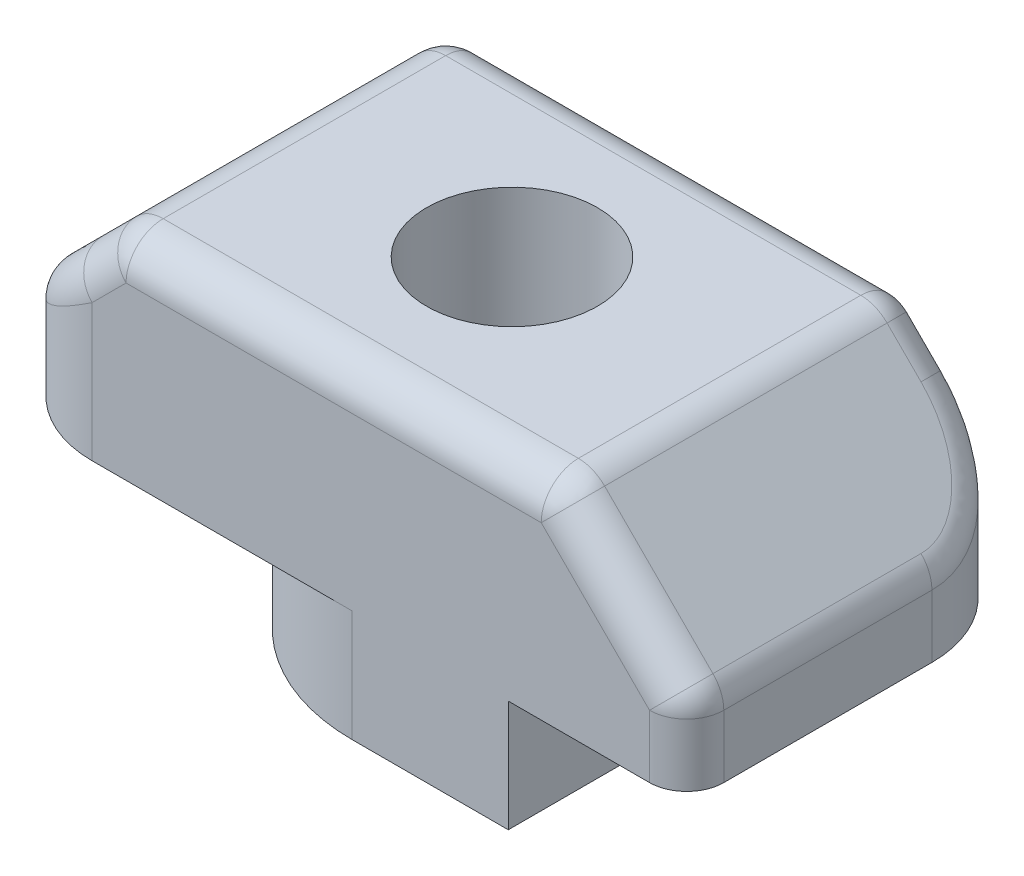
ISO-10303-21;
HEADER;
FILE_DESCRIPTION(('STEP AP214'),'2;1');
FILE_NAME('part.step','',(''),(''),'','','');
FILE_SCHEMA(('AUTOMOTIVE_DESIGN { 1 0 10303 214 1 1 1 1 }'));
ENDSEC;
DATA;
#1=APPLICATION_CONTEXT('core data for automotive mechanical design processes');
#2=APPLICATION_PROTOCOL_DEFINITION('international standard','automotive_design',2000,#1);
#3=PRODUCT_CONTEXT('',#1,'mechanical');
#4=PRODUCT('Part','Part','',(#3));
#5=PRODUCT_RELATED_PRODUCT_CATEGORY('part','',(#4));
#6=PRODUCT_DEFINITION_FORMATION('','',#4);
#7=PRODUCT_DEFINITION_CONTEXT('part definition',#1,'design');
#8=PRODUCT_DEFINITION('design','',#6,#7);
#9=PRODUCT_DEFINITION_SHAPE('','',#8);
#10=(LENGTH_UNIT() NAMED_UNIT(*) SI_UNIT(.MILLI.,.METRE.));
#11=(NAMED_UNIT(*) PLANE_ANGLE_UNIT() SI_UNIT($,.RADIAN.));
#12=(NAMED_UNIT(*) SI_UNIT($,.STERADIAN.) SOLID_ANGLE_UNIT());
#13=UNCERTAINTY_MEASURE_WITH_UNIT(LENGTH_MEASURE(1.E-05),#10,'distance_accuracy_value','');
#14=(GEOMETRIC_REPRESENTATION_CONTEXT(3) GLOBAL_UNCERTAINTY_ASSIGNED_CONTEXT((#13)) GLOBAL_UNIT_ASSIGNED_CONTEXT((#10,
#11,#12)) REPRESENTATION_CONTEXT('',''));
#15=CARTESIAN_POINT('',(0.,0.,0.));
#16=DIRECTION('',(0.,0.,1.));
#17=DIRECTION('',(1.,0.,0.));
#18=AXIS2_PLACEMENT_3D('',#15,#16,#17);
#19=CARTESIAN_POINT('',(-2.87628865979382,3.31615120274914,6.6));
#20=DIRECTION('',(0.,-1.,0.));
#21=DIRECTION('',(1.,0.,0.));
#22=AXIS2_PLACEMENT_3D('',#19,#20,#21);
#23=CYLINDRICAL_SURFACE('',#22,3.);
#24=DIRECTION('',(0.,1.,0.));
#25=VECTOR('',#24,1.);
#26=CARTESIAN_POINT('',(-2.87628865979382,3.31615120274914,9.6));
#27=LINE('',#26,#25);
#28=CARTESIAN_POINT('',(-2.87628865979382,1.40193764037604,9.6));
#29=VERTEX_POINT('',#28);
#30=CARTESIAN_POINT('',(-2.87628865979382,-2.28384879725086,9.6));
#31=VERTEX_POINT('',#30);
#32=EDGE_CURVE('E297',#29,#31,#27,.F.);
#33=ORIENTED_EDGE('',*,*,#32,.F.);
#34=CARTESIAN_POINT('',(-2.87628865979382,1.40193764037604,6.6));
#35=DIRECTION('',(-0.554700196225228,0.832050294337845,0.));
#36=DIRECTION('',(-0.832050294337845,-0.554700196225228,0.));
#37=AXIS2_PLACEMENT_3D('',#34,#35,#36);
#38=ELLIPSE('',#37,3.60555127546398,3.);
#39=CARTESIAN_POINT('',(-5.87628865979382,-0.598062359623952,6.6));
#40=VERTEX_POINT('',#39);
#41=EDGE_CURVE('E446',#29,#40,#38,.F.);
#42=ORIENTED_EDGE('',*,*,#41,.T.);
#43=DIRECTION('',(0.,1.,0.));
#44=VECTOR('',#43,1.);
#45=CARTESIAN_POINT('',(-5.87628865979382,3.31615120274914,6.6));
#46=LINE('',#45,#44);
#47=CARTESIAN_POINT('',(-5.87628865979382,-2.28384879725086,6.6));
#48=VERTEX_POINT('',#47);
#49=EDGE_CURVE('E294',#48,#40,#46,.T.);
#50=ORIENTED_EDGE('',*,*,#49,.F.);
#51=CARTESIAN_POINT('',(-2.87628865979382,-2.28384879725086,6.6));
#52=DIRECTION('',(0.,-1.,0.));
#53=DIRECTION('',(0.,0.,-1.));
#54=AXIS2_PLACEMENT_3D('',#51,#52,#53);
#55=CIRCLE('',#54,3.);
#56=EDGE_CURVE('E299',#31,#48,#55,.T.);
#57=ORIENTED_EDGE('',*,*,#56,.F.);
#58=EDGE_LOOP('',(#33,#42,#50,#57));
#59=FACE_BOUND('',#58,.T.);
#60=ADVANCED_FACE('F35',(#59),#23,.T.);
#61=CARTESIAN_POINT('',(10.1237113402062,0.,3.));
#62=DIRECTION('',(0.,-1.,0.));
#63=DIRECTION('',(1.,0.,0.));
#64=AXIS2_PLACEMENT_3D('',#61,#62,#63);
#65=CYLINDRICAL_SURFACE('',#64,3.);
#66=DIRECTION('',(0.,-1.,0.));
#67=VECTOR('',#66,1.);
#68=CARTESIAN_POINT('',(10.1237113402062,0.,0.));
#69=LINE('',#68,#67);
#70=CARTESIAN_POINT('',(10.1237113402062,1.40193764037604,0.));
#71=VERTEX_POINT('',#70);
#72=CARTESIAN_POINT('',(10.1237113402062,-2.28384879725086,0.));
#73=VERTEX_POINT('',#72);
#74=EDGE_CURVE('E286',#71,#73,#69,.T.);
#75=ORIENTED_EDGE('',*,*,#74,.F.);
#76=CARTESIAN_POINT('',(10.1237113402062,1.40193764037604,3.));
#77=DIRECTION('',(0.554700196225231,0.832050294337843,0.));
#78=DIRECTION('',(0.832050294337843,-0.554700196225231,0.));
#79=AXIS2_PLACEMENT_3D('',#76,#77,#78);
#80=ELLIPSE('',#79,3.60555127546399,3.);
#81=CARTESIAN_POINT('',(13.1237113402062,-0.598062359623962,3.));
#82=VERTEX_POINT('',#81);
#83=EDGE_CURVE('E308',#71,#82,#80,.F.);
#84=ORIENTED_EDGE('',*,*,#83,.T.);
#85=DIRECTION('',(0.,-1.,0.));
#86=VECTOR('',#85,1.);
#87=CARTESIAN_POINT('',(13.1237113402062,3.31615120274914,3.));
#88=LINE('',#87,#86);
#89=CARTESIAN_POINT('',(13.1237113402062,-2.28384879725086,3.));
#90=VERTEX_POINT('',#89);
#91=EDGE_CURVE('E288',#90,#82,#88,.F.);
#92=ORIENTED_EDGE('',*,*,#91,.F.);
#93=CARTESIAN_POINT('',(10.1237113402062,-2.28384879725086,3.));
#94=DIRECTION('',(0.,-1.,0.));
#95=DIRECTION('',(0.,0.,-1.));
#96=AXIS2_PLACEMENT_3D('',#93,#94,#95);
#97=CIRCLE('',#96,3.);
#98=EDGE_CURVE('E291',#73,#90,#97,.T.);
#99=ORIENTED_EDGE('',*,*,#98,.F.);
#100=EDGE_LOOP('',(#75,#84,#92,#99));
#101=FACE_BOUND('',#100,.T.);
#102=ADVANCED_FACE('F356',(#101),#65,.T.);
#103=CARTESIAN_POINT('',(-5.87628865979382,-5.28384879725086,9.6));
#104=DIRECTION('',(0.,1.,0.));
#105=DIRECTION('',(0.,0.,1.));
#106=AXIS2_PLACEMENT_3D('',#103,#104,#105);
#107=PLANE('',#106);
#108=CARTESIAN_POINT('',(3.62371134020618,-5.28384879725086,4.8));
#109=DIRECTION('',(0.,-1.,0.));
#110=DIRECTION('',(0.,0.,-1.));
#111=AXIS2_PLACEMENT_3D('',#108,#109,#110);
#112=CIRCLE('',#111,2.3);
#113=CARTESIAN_POINT('',(3.62371134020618,-5.28384879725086,2.5));
#114=VERTEX_POINT('',#113);
#115=EDGE_CURVE('E250',#114,#114,#112,.T.);
#116=ORIENTED_EDGE('',*,*,#115,.F.);
#117=EDGE_LOOP('',(#116));
#118=FACE_BOUND('',#117,.T.);
#119=DIRECTION('',(1.,0.,0.));
#120=VECTOR('',#119,1.);
#121=CARTESIAN_POINT('',(-5.87628865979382,-5.28384879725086,9.6));
#122=LINE('',#121,#120);
#123=CARTESIAN_POINT('',(4.12371134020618,-5.28384879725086,9.6));
#124=VERTEX_POINT('',#123);
#125=CARTESIAN_POINT('',(8.32371134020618,-5.28384879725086,9.6));
#126=VERTEX_POINT('',#125);
#127=EDGE_CURVE('E244',#124,#126,#122,.T.);
#128=ORIENTED_EDGE('',*,*,#127,.F.);
#129=CARTESIAN_POINT('',(4.12371134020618,-5.28384879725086,4.4));
#130=DIRECTION('',(0.,1.,0.));
#131=DIRECTION('',(0.,0.,1.));
#132=AXIS2_PLACEMENT_3D('',#129,#130,#131);
#133=CIRCLE('',#132,5.2);
#134=CARTESIAN_POINT('',(-1.07628865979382,-5.28384879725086,4.4));
#135=VERTEX_POINT('',#134);
#136=EDGE_CURVE('E275',#124,#135,#133,.F.);
#137=ORIENTED_EDGE('',*,*,#136,.T.);
#138=DIRECTION('',(0.,0.,-1.));
#139=VECTOR('',#138,1.);
#140=CARTESIAN_POINT('',(-1.07628865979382,-5.28384879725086,15.260388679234));
#141=LINE('',#140,#139);
#142=CARTESIAN_POINT('',(-1.07628865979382,-5.28384879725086,0.));
#143=VERTEX_POINT('',#142);
#144=EDGE_CURVE('E219',#135,#143,#141,.T.);
#145=ORIENTED_EDGE('',*,*,#144,.T.);
#146=DIRECTION('',(1.,0.,0.));
#147=VECTOR('',#146,1.);
#148=CARTESIAN_POINT('',(-5.87628865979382,-5.28384879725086,0.));
#149=LINE('',#148,#147);
#150=CARTESIAN_POINT('',(3.12371134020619,-5.28384879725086,0.));
#151=VERTEX_POINT('',#150);
#152=EDGE_CURVE('E218',#143,#151,#149,.T.);
#153=ORIENTED_EDGE('',*,*,#152,.T.);
#154=CARTESIAN_POINT('',(3.12371134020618,-5.28384879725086,5.2));
#155=DIRECTION('',(0.,1.,0.));
#156=DIRECTION('',(0.,0.,1.));
#157=AXIS2_PLACEMENT_3D('',#154,#155,#156);
#158=CIRCLE('',#157,5.2);
#159=CARTESIAN_POINT('',(8.32371134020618,-5.28384879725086,5.2));
#160=VERTEX_POINT('',#159);
#161=EDGE_CURVE('E273',#151,#160,#158,.F.);
#162=ORIENTED_EDGE('',*,*,#161,.T.);
#163=DIRECTION('',(0.,0.,-1.));
#164=VECTOR('',#163,1.);
#165=CARTESIAN_POINT('',(8.32371134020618,-5.28384879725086,15.260388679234));
#166=LINE('',#165,#164);
#167=EDGE_CURVE('E238',#126,#160,#166,.T.);
#168=ORIENTED_EDGE('',*,*,#167,.F.);
#169=EDGE_LOOP('',(#128,#137,#145,#153,#162,#168));
#170=FACE_BOUND('',#169,.T.);
#171=ADVANCED_FACE('F360',(#118,#170),#107,.F.);
#172=CARTESIAN_POINT('',(0.,0.,9.6));
#173=DIRECTION('',(0.,0.,1.));
#174=DIRECTION('',(1.,0.,0.));
#175=AXIS2_PLACEMENT_3D('',#172,#173,#174);
#176=PLANE('',#175);
#177=DIRECTION('',(-1.,0.,0.));
#178=VECTOR('',#177,1.);
#179=CARTESIAN_POINT('',(-1.96207509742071,2.31615120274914,9.6));
#180=LINE('',#179,#178);
#181=CARTESIAN_POINT('',(9.20949777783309,2.31615120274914,9.6));
#182=VERTEX_POINT('',#181);
#183=CARTESIAN_POINT('',(-1.96207509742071,2.31615120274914,9.6));
#184=VERTEX_POINT('',#183);
#185=EDGE_CURVE('E441',#182,#184,#180,.T.);
#186=ORIENTED_EDGE('',*,*,#185,.T.);
#187=DIRECTION('',(0.707106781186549,0.707106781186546,0.));
#188=VECTOR('',#187,1.);
#189=CARTESIAN_POINT('',(-2.13911315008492,2.13911315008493,9.6));
#190=LINE('',#189,#188);
#191=EDGE_CURVE('E439',#184,#29,#190,.F.);
#192=ORIENTED_EDGE('',*,*,#191,.T.);
#193=ORIENTED_EDGE('',*,*,#32,.T.);
#194=DIRECTION('',(-1.,0.,0.));
#195=VECTOR('',#194,1.);
#196=CARTESIAN_POINT('',(-5.87628865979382,-2.28384879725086,9.6));
#197=LINE('',#196,#195);
#198=CARTESIAN_POINT('',(4.12371134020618,-2.28384879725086,9.6));
#199=VERTEX_POINT('',#198);
#200=EDGE_CURVE('E213',#199,#31,#197,.T.);
#201=ORIENTED_EDGE('',*,*,#200,.F.);
#202=DIRECTION('',(0.,1.,0.));
#203=VECTOR('',#202,1.);
#204=CARTESIAN_POINT('',(4.12371134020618,0.,9.6));
#205=LINE('',#204,#203);
#206=EDGE_CURVE('E271',#199,#124,#205,.F.);
#207=ORIENTED_EDGE('',*,*,#206,.T.);
#208=ORIENTED_EDGE('',*,*,#127,.T.);
#209=DIRECTION('',(0.,-1.,0.));
#210=VECTOR('',#209,1.);
#211=CARTESIAN_POINT('',(8.32371134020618,-5.28384879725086,9.6));
#212=LINE('',#211,#210);
#213=CARTESIAN_POINT('',(8.32371134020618,-2.28384879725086,9.6));
#214=VERTEX_POINT('',#213);
#215=EDGE_CURVE('E234',#214,#126,#212,.T.);
#216=ORIENTED_EDGE('',*,*,#215,.F.);
#217=DIRECTION('',(-1.,0.,0.));
#218=VECTOR('',#217,1.);
#219=CARTESIAN_POINT('',(8.32371134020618,-2.28384879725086,9.6));
#220=LINE('',#219,#218);
#221=CARTESIAN_POINT('',(12.1237113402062,-2.28384879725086,9.6));
#222=VERTEX_POINT('',#221);
#223=EDGE_CURVE('E232',#222,#214,#220,.T.);
#224=ORIENTED_EDGE('',*,*,#223,.F.);
#225=DIRECTION('',(0.,1.,0.));
#226=VECTOR('',#225,1.);
#227=CARTESIAN_POINT('',(12.1237113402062,-0.59806235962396,9.6));
#228=LINE('',#227,#226);
#229=CARTESIAN_POINT('',(12.1237113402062,-0.598062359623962,9.6));
#230=VERTEX_POINT('',#229);
#231=EDGE_CURVE('E427',#222,#230,#228,.T.);
#232=ORIENTED_EDGE('',*,*,#231,.T.);
#233=DIRECTION('',(0.707106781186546,-0.707106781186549,0.));
#234=VECTOR('',#233,1.);
#235=CARTESIAN_POINT('',(5.76282449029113,5.76282449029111,9.6));
#236=LINE('',#235,#234);
#237=EDGE_CURVE('E443',#230,#182,#236,.F.);
#238=ORIENTED_EDGE('',*,*,#237,.T.);
#239=EDGE_LOOP('',(#186,#192,#193,#201,#207,#208,#216,#224,#232,#238));
#240=FACE_BOUND('',#239,.T.);
#241=ADVANCED_FACE('F536',(#240),#176,.T.);
#242=CARTESIAN_POINT('',(0.,0.,0.));
#243=DIRECTION('',(0.,0.,1.));
#244=DIRECTION('',(1.,0.,0.));
#245=AXIS2_PLACEMENT_3D('',#242,#243,#244);
#246=PLANE('',#245);
#247=DIRECTION('',(-1.,0.,0.));
#248=VECTOR('',#247,1.);
#249=CARTESIAN_POINT('',(0.,2.31615120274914,0.));
#250=LINE('',#249,#248);
#251=CARTESIAN_POINT('',(-1.96207509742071,2.31615120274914,0.));
#252=VERTEX_POINT('',#251);
#253=CARTESIAN_POINT('',(9.20949777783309,2.31615120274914,0.));
#254=VERTEX_POINT('',#253);
#255=EDGE_CURVE('E314',#252,#254,#250,.F.);
#256=ORIENTED_EDGE('',*,*,#255,.T.);
#257=DIRECTION('',(-0.707106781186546,0.707106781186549,0.));
#258=VECTOR('',#257,1.);
#259=CARTESIAN_POINT('',(9.41660455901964,2.1090444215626,0.));
#260=LINE('',#259,#258);
#261=EDGE_CURVE('E316',#254,#71,#260,.F.);
#262=ORIENTED_EDGE('',*,*,#261,.T.);
#263=ORIENTED_EDGE('',*,*,#74,.T.);
#264=DIRECTION('',(-1.,0.,0.));
#265=VECTOR('',#264,1.);
#266=CARTESIAN_POINT('',(8.32371134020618,-2.28384879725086,0.));
#267=LINE('',#266,#265);
#268=CARTESIAN_POINT('',(3.12371134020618,-2.28384879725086,0.));
#269=VERTEX_POINT('',#268);
#270=EDGE_CURVE('E230',#73,#269,#267,.T.);
#271=ORIENTED_EDGE('',*,*,#270,.T.);
#272=DIRECTION('',(0.,-1.,0.));
#273=VECTOR('',#272,1.);
#274=CARTESIAN_POINT('',(3.12371134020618,-5.28384879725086,0.));
#275=LINE('',#274,#273);
#276=EDGE_CURVE('E277',#269,#151,#275,.T.);
#277=ORIENTED_EDGE('',*,*,#276,.T.);
#278=ORIENTED_EDGE('',*,*,#152,.F.);
#279=DIRECTION('',(0.,1.,0.));
#280=VECTOR('',#279,1.);
#281=CARTESIAN_POINT('',(-1.07628865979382,-5.28384879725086,0.));
#282=LINE('',#281,#280);
#283=CARTESIAN_POINT('',(-1.07628865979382,-2.28384879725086,0.));
#284=VERTEX_POINT('',#283);
#285=EDGE_CURVE('E198',#143,#284,#282,.T.);
#286=ORIENTED_EDGE('',*,*,#285,.T.);
#287=DIRECTION('',(-1.,0.,0.));
#288=VECTOR('',#287,1.);
#289=CARTESIAN_POINT('',(-5.87628865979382,-2.28384879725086,0.));
#290=LINE('',#289,#288);
#291=CARTESIAN_POINT('',(-4.87628865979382,-2.28384879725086,0.));
#292=VERTEX_POINT('',#291);
#293=EDGE_CURVE('E204',#284,#292,#290,.T.);
#294=ORIENTED_EDGE('',*,*,#293,.T.);
#295=DIRECTION('',(0.,-1.,0.));
#296=VECTOR('',#295,1.);
#297=CARTESIAN_POINT('',(-4.87628865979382,0.,0.));
#298=LINE('',#297,#296);
#299=CARTESIAN_POINT('',(-4.87628865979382,-0.598062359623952,0.));
#300=VERTEX_POINT('',#299);
#301=EDGE_CURVE('E310',#292,#300,#298,.F.);
#302=ORIENTED_EDGE('',*,*,#301,.T.);
#303=DIRECTION('',(-0.707106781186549,-0.707106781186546,0.));
#304=VECTOR('',#303,1.);
#305=CARTESIAN_POINT('',(-1.96207509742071,2.31615120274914,0.));
#306=LINE('',#305,#304);
#307=EDGE_CURVE('E312',#300,#252,#306,.F.);
#308=ORIENTED_EDGE('',*,*,#307,.T.);
#309=EDGE_LOOP('',(#256,#262,#263,#271,#277,#278,#286,#294,#302,#308));
#310=FACE_BOUND('',#309,.T.);
#311=ADVANCED_FACE('F215',(#310),#246,.F.);
#312=CARTESIAN_POINT('',(-5.87628865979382,3.31615120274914,9.6));
#313=DIRECTION('',(1.,0.,0.));
#314=DIRECTION('',(0.,1.,0.));
#315=AXIS2_PLACEMENT_3D('',#312,#313,#314);
#316=PLANE('',#315);
#317=DIRECTION('',(0.,0.,1.));
#318=VECTOR('',#317,1.);
#319=CARTESIAN_POINT('',(-5.87628865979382,-0.598062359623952,0.));
#320=LINE('',#319,#318);
#321=CARTESIAN_POINT('',(-5.87628865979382,-0.598062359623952,0.999999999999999));
#322=VERTEX_POINT('',#321);
#323=EDGE_CURVE('E246',#40,#322,#320,.F.);
#324=ORIENTED_EDGE('',*,*,#323,.T.);
#325=DIRECTION('',(0.,-1.,0.));
#326=VECTOR('',#325,1.);
#327=CARTESIAN_POINT('',(-5.87628865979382,3.31615120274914,0.999999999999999));
#328=LINE('',#327,#326);
#329=CARTESIAN_POINT('',(-5.87628865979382,-2.28384879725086,1.));
#330=VERTEX_POINT('',#329);
#331=EDGE_CURVE('E330',#322,#330,#328,.T.);
#332=ORIENTED_EDGE('',*,*,#331,.T.);
#333=DIRECTION('',(0.,0.,-1.));
#334=VECTOR('',#333,1.);
#335=CARTESIAN_POINT('',(-5.87628865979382,-2.28384879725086,15.260388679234));
#336=LINE('',#335,#334);
#337=EDGE_CURVE('E221',#48,#330,#336,.T.);
#338=ORIENTED_EDGE('',*,*,#337,.F.);
#339=ORIENTED_EDGE('',*,*,#49,.T.);
#340=EDGE_LOOP('',(#324,#332,#338,#339));
#341=FACE_BOUND('',#340,.T.);
#342=ADVANCED_FACE('F511',(#341),#316,.F.);
#343=CARTESIAN_POINT('',(13.1237113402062,3.31615120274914,9.6));
#344=DIRECTION('',(-1.,0.,0.));
#345=DIRECTION('',(0.,-1.,0.));
#346=AXIS2_PLACEMENT_3D('',#343,#344,#345);
#347=PLANE('',#346);
#348=DIRECTION('',(0.,0.,-1.));
#349=VECTOR('',#348,1.);
#350=CARTESIAN_POINT('',(13.1237113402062,-0.598062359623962,9.6));
#351=LINE('',#350,#349);
#352=CARTESIAN_POINT('',(13.1237113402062,-0.598062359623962,8.6));
#353=VERTEX_POINT('',#352);
#354=EDGE_CURVE('E263',#82,#353,#351,.F.);
#355=ORIENTED_EDGE('',*,*,#354,.T.);
#356=DIRECTION('',(0.,1.,0.));
#357=VECTOR('',#356,1.);
#358=CARTESIAN_POINT('',(13.1237113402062,-2.28384879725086,8.6));
#359=LINE('',#358,#357);
#360=CARTESIAN_POINT('',(13.1237113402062,-2.28384879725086,8.6));
#361=VERTEX_POINT('',#360);
#362=EDGE_CURVE('E44',#353,#361,#359,.F.);
#363=ORIENTED_EDGE('',*,*,#362,.T.);
#364=DIRECTION('',(0.,0.,-1.));
#365=VECTOR('',#364,1.);
#366=CARTESIAN_POINT('',(13.1237113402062,-2.28384879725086,15.260388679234));
#367=LINE('',#366,#365);
#368=EDGE_CURVE('E233',#361,#90,#367,.T.);
#369=ORIENTED_EDGE('',*,*,#368,.T.);
#370=ORIENTED_EDGE('',*,*,#91,.T.);
#371=EDGE_LOOP('',(#355,#363,#369,#370));
#372=FACE_BOUND('',#371,.T.);
#373=ADVANCED_FACE('F553',(#372),#347,.F.);
#374=CARTESIAN_POINT('',(-5.87628865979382,3.31615120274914,9.6));
#375=DIRECTION('',(0.,-1.,0.));
#376=DIRECTION('',(0.,0.,-1.));
#377=AXIS2_PLACEMENT_3D('',#374,#375,#376);
#378=PLANE('',#377);
#379=CARTESIAN_POINT('',(3.62371134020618,3.31615120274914,4.8));
#380=DIRECTION('',(0.,-1.,0.));
#381=DIRECTION('',(0.,0.,-1.));
#382=AXIS2_PLACEMENT_3D('',#379,#380,#381);
#383=CIRCLE('',#382,2.3);
#384=CARTESIAN_POINT('',(3.62371134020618,3.31615120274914,2.5));
#385=VERTEX_POINT('',#384);
#386=EDGE_CURVE('E229',#385,#385,#383,.T.);
#387=ORIENTED_EDGE('',*,*,#386,.T.);
#388=EDGE_LOOP('',(#387));
#389=FACE_BOUND('',#388,.T.);
#390=DIRECTION('',(0.,0.,-1.));
#391=VECTOR('',#390,1.);
#392=CARTESIAN_POINT('',(-1.96207509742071,3.31615120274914,9.6));
#393=LINE('',#392,#391);
#394=CARTESIAN_POINT('',(-1.96207509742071,3.31615120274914,0.999999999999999));
#395=VERTEX_POINT('',#394);
#396=CARTESIAN_POINT('',(-1.96207509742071,3.31615120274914,8.6));
#397=VERTEX_POINT('',#396);
#398=EDGE_CURVE('E260',#395,#397,#393,.F.);
#399=ORIENTED_EDGE('',*,*,#398,.T.);
#400=DIRECTION('',(-1.,0.,0.));
#401=VECTOR('',#400,1.);
#402=CARTESIAN_POINT('',(9.20949777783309,3.31615120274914,8.6));
#403=LINE('',#402,#401);
#404=CARTESIAN_POINT('',(9.20949777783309,3.31615120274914,8.6));
#405=VERTEX_POINT('',#404);
#406=EDGE_CURVE('E435',#397,#405,#403,.F.);
#407=ORIENTED_EDGE('',*,*,#406,.T.);
#408=DIRECTION('',(0.,0.,1.));
#409=VECTOR('',#408,1.);
#410=CARTESIAN_POINT('',(9.20949777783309,3.31615120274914,0.));
#411=LINE('',#410,#409);
#412=CARTESIAN_POINT('',(9.20949777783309,3.31615120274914,0.999999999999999));
#413=VERTEX_POINT('',#412);
#414=EDGE_CURVE('E258',#405,#413,#411,.F.);
#415=ORIENTED_EDGE('',*,*,#414,.T.);
#416=DIRECTION('',(-1.,0.,0.));
#417=VECTOR('',#416,1.);
#418=CARTESIAN_POINT('',(-5.87628865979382,3.31615120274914,0.999999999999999));
#419=LINE('',#418,#417);
#420=EDGE_CURVE('E321',#413,#395,#419,.T.);
#421=ORIENTED_EDGE('',*,*,#420,.T.);
#422=EDGE_LOOP('',(#399,#407,#415,#421));
#423=FACE_BOUND('',#422,.T.);
#424=ADVANCED_FACE('F487',(#389,#423),#378,.F.);
#425=CARTESIAN_POINT('',(8.32371134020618,-5.28384879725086,15.260388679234));
#426=DIRECTION('',(1.,0.,0.));
#427=DIRECTION('',(0.,0.,-1.));
#428=AXIS2_PLACEMENT_3D('',#425,#426,#427);
#429=PLANE('',#428);
#430=ORIENTED_EDGE('',*,*,#167,.T.);
#431=DIRECTION('',(0.,-1.,0.));
#432=VECTOR('',#431,1.);
#433=CARTESIAN_POINT('',(8.32371134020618,-2.28384879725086,5.2));
#434=LINE('',#433,#432);
#435=CARTESIAN_POINT('',(8.32371134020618,-2.28384879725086,5.2));
#436=VERTEX_POINT('',#435);
#437=EDGE_CURVE('E279',#160,#436,#434,.F.);
#438=ORIENTED_EDGE('',*,*,#437,.T.);
#439=DIRECTION('',(0.,0.,-1.));
#440=VECTOR('',#439,1.);
#441=CARTESIAN_POINT('',(8.32371134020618,-2.28384879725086,15.260388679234));
#442=LINE('',#441,#440);
#443=EDGE_CURVE('E226',#214,#436,#442,.T.);
#444=ORIENTED_EDGE('',*,*,#443,.F.);
#445=ORIENTED_EDGE('',*,*,#215,.T.);
#446=EDGE_LOOP('',(#430,#438,#444,#445));
#447=FACE_BOUND('',#446,.T.);
#448=ADVANCED_FACE('F544',(#447),#429,.T.);
#449=CARTESIAN_POINT('',(8.32371134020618,-2.28384879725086,15.260388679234));
#450=DIRECTION('',(0.,-1.,0.));
#451=DIRECTION('',(0.,0.,-1.));
#452=AXIS2_PLACEMENT_3D('',#449,#450,#451);
#453=PLANE('',#452);
#454=ORIENTED_EDGE('',*,*,#368,.F.);
#455=CARTESIAN_POINT('',(12.1237113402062,-2.28384879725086,8.6));
#456=DIRECTION('',(0.,-1.,0.));
#457=DIRECTION('',(0.,0.,-1.));
#458=AXIS2_PLACEMENT_3D('',#455,#456,#457);
#459=CIRCLE('',#458,1.);
#460=EDGE_CURVE('E11',#361,#222,#459,.T.);
#461=ORIENTED_EDGE('',*,*,#460,.T.);
#462=ORIENTED_EDGE('',*,*,#223,.T.);
#463=ORIENTED_EDGE('',*,*,#443,.T.);
#464=CARTESIAN_POINT('',(3.12371134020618,-2.28384879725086,5.2));
#465=DIRECTION('',(0.,-1.,0.));
#466=DIRECTION('',(0.,0.,-1.));
#467=AXIS2_PLACEMENT_3D('',#464,#465,#466);
#468=CIRCLE('',#467,5.2);
#469=EDGE_CURVE('E283',#436,#269,#468,.F.);
#470=ORIENTED_EDGE('',*,*,#469,.T.);
#471=ORIENTED_EDGE('',*,*,#270,.F.);
#472=ORIENTED_EDGE('',*,*,#98,.T.);
#473=EDGE_LOOP('',(#454,#461,#462,#463,#470,#471,#472));
#474=FACE_BOUND('',#473,.T.);
#475=ADVANCED_FACE('F541',(#474),#453,.T.);
#476=CARTESIAN_POINT('',(-1.07628865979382,-5.28384879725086,15.260388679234));
#477=DIRECTION('',(-1.,0.,0.));
#478=DIRECTION('',(0.,0.,1.));
#479=AXIS2_PLACEMENT_3D('',#476,#477,#478);
#480=PLANE('',#479);
#481=ORIENTED_EDGE('',*,*,#144,.F.);
#482=DIRECTION('',(0.,1.,0.));
#483=VECTOR('',#482,1.);
#484=CARTESIAN_POINT('',(-1.07628865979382,-5.28384879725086,4.4));
#485=LINE('',#484,#483);
#486=CARTESIAN_POINT('',(-1.07628865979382,-2.28384879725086,4.4));
#487=VERTEX_POINT('',#486);
#488=EDGE_CURVE('E201',#135,#487,#485,.T.);
#489=ORIENTED_EDGE('',*,*,#488,.T.);
#490=DIRECTION('',(0.,0.,-1.));
#491=VECTOR('',#490,1.);
#492=CARTESIAN_POINT('',(-1.07628865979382,-2.28384879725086,15.260388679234));
#493=LINE('',#492,#491);
#494=EDGE_CURVE('E193',#487,#284,#493,.T.);
#495=ORIENTED_EDGE('',*,*,#494,.T.);
#496=ORIENTED_EDGE('',*,*,#285,.F.);
#497=EDGE_LOOP('',(#481,#489,#495,#496));
#498=FACE_BOUND('',#497,.T.);
#499=ADVANCED_FACE('F196',(#498),#480,.T.);
#500=CARTESIAN_POINT('',(-5.87628865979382,-2.28384879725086,15.260388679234));
#501=DIRECTION('',(0.,-1.,0.));
#502=DIRECTION('',(0.,0.,-1.));
#503=AXIS2_PLACEMENT_3D('',#500,#501,#502);
#504=PLANE('',#503);
#505=ORIENTED_EDGE('',*,*,#337,.T.);
#506=CARTESIAN_POINT('',(-4.87628865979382,-2.28384879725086,0.999999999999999));
#507=DIRECTION('',(0.,-1.,0.));
#508=DIRECTION('',(0.,0.,-1.));
#509=AXIS2_PLACEMENT_3D('',#506,#507,#508);
#510=CIRCLE('',#509,1.);
#511=EDGE_CURVE('E210',#330,#292,#510,.T.);
#512=ORIENTED_EDGE('',*,*,#511,.T.);
#513=ORIENTED_EDGE('',*,*,#293,.F.);
#514=ORIENTED_EDGE('',*,*,#494,.F.);
#515=CARTESIAN_POINT('',(4.12371134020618,-2.28384879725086,4.4));
#516=DIRECTION('',(0.,-1.,0.));
#517=DIRECTION('',(0.,0.,-1.));
#518=AXIS2_PLACEMENT_3D('',#515,#516,#517);
#519=CIRCLE('',#518,5.2);
#520=EDGE_CURVE('E281',#487,#199,#519,.F.);
#521=ORIENTED_EDGE('',*,*,#520,.T.);
#522=ORIENTED_EDGE('',*,*,#200,.T.);
#523=ORIENTED_EDGE('',*,*,#56,.T.);
#524=EDGE_LOOP('',(#505,#512,#513,#514,#521,#522,#523));
#525=FACE_BOUND('',#524,.T.);
#526=ADVANCED_FACE('F208',(#525),#504,.T.);
#527=CARTESIAN_POINT('',(3.62371134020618,3.71615120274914,4.8));
#528=DIRECTION('',(0.,-1.,0.));
#529=DIRECTION('',(0.,0.,-1.));
#530=AXIS2_PLACEMENT_3D('',#527,#528,#529);
#531=CYLINDRICAL_SURFACE('',#530,2.3);
#532=ORIENTED_EDGE('',*,*,#115,.T.);
#533=EDGE_LOOP('',(#532));
#534=FACE_BOUND('',#533,.T.);
#535=ORIENTED_EDGE('',*,*,#386,.F.);
#536=EDGE_LOOP('',(#535));
#537=FACE_BOUND('',#536,.T.);
#538=ADVANCED_FACE('F756',(#534,#537),#531,.F.);
#539=CARTESIAN_POINT('',(9.62371134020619,3.31615120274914,9.6));
#540=DIRECTION('',(-0.707106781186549,-0.707106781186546,0.));
#541=DIRECTION('',(0.,0.,-1.));
#542=AXIS2_PLACEMENT_3D('',#539,#540,#541);
#543=PLANE('',#542);
#544=DIRECTION('',(0.,0.,-1.));
#545=VECTOR('',#544,1.);
#546=CARTESIAN_POINT('',(9.91660455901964,3.02325798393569,9.6));
#547=LINE('',#546,#545);
#548=CARTESIAN_POINT('',(9.91660455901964,3.02325798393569,0.999999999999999));
#549=VERTEX_POINT('',#548);
#550=CARTESIAN_POINT('',(9.91660455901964,3.02325798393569,8.6));
#551=VERTEX_POINT('',#550);
#552=EDGE_CURVE('E265',#549,#551,#547,.F.);
#553=ORIENTED_EDGE('',*,*,#552,.T.);
#554=DIRECTION('',(-0.707106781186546,0.707106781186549,0.));
#555=VECTOR('',#554,1.);
#556=CARTESIAN_POINT('',(9.62371134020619,3.31615120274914,8.6));
#557=LINE('',#556,#555);
#558=CARTESIAN_POINT('',(12.8308181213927,0.109044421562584,8.6));
#559=VERTEX_POINT('',#558);
#560=EDGE_CURVE('E429',#551,#559,#557,.F.);
#561=ORIENTED_EDGE('',*,*,#560,.T.);
#562=DIRECTION('',(0.,0.,1.));
#563=VECTOR('',#562,1.);
#564=CARTESIAN_POINT('',(12.8308181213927,0.109044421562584,0.));
#565=LINE('',#564,#563);
#566=CARTESIAN_POINT('',(12.8308181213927,0.109044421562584,3.));
#567=VERTEX_POINT('',#566);
#568=EDGE_CURVE('E268',#559,#567,#565,.F.);
#569=ORIENTED_EDGE('',*,*,#568,.T.);
#570=CARTESIAN_POINT('',(10.8308181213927,2.10904442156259,3.));
#571=DIRECTION('',(-0.707106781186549,-0.707106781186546,0.));
#572=DIRECTION('',(0.707106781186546,-0.707106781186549,0.));
#573=AXIS2_PLACEMENT_3D('',#570,#571,#572);
#574=ELLIPSE('',#573,2.8284271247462,2.);
#575=CARTESIAN_POINT('',(10.8308181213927,2.10904442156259,1.));
#576=VERTEX_POINT('',#575);
#577=EDGE_CURVE('E306',#567,#576,#574,.F.);
#578=ORIENTED_EDGE('',*,*,#577,.T.);
#579=DIRECTION('',(0.707106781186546,-0.707106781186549,0.));
#580=VECTOR('',#579,1.);
#581=CARTESIAN_POINT('',(9.91660455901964,3.02325798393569,1.));
#582=LINE('',#581,#580);
#583=EDGE_CURVE('E304',#576,#549,#582,.F.);
#584=ORIENTED_EDGE('',*,*,#583,.T.);
#585=EDGE_LOOP('',(#553,#561,#569,#578,#584));
#586=FACE_BOUND('',#585,.T.);
#587=ADVANCED_FACE('F352',(#586),#543,.F.);
#588=CARTESIAN_POINT('',(-5.87628865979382,-0.183848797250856,9.6));
#589=DIRECTION('',(0.707106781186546,-0.707106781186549,0.));
#590=DIRECTION('',(0.,0.,-1.));
#591=AXIS2_PLACEMENT_3D('',#588,#589,#590);
#592=PLANE('',#591);
#593=DIRECTION('',(0.,0.,-1.));
#594=VECTOR('',#593,1.);
#595=CARTESIAN_POINT('',(-5.58339544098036,0.109044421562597,9.6));
#596=LINE('',#595,#594);
#597=CARTESIAN_POINT('',(-5.58339544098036,0.109044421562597,0.999999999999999));
#598=VERTEX_POINT('',#597);
#599=CARTESIAN_POINT('',(-5.58339544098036,0.109044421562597,6.6));
#600=VERTEX_POINT('',#599);
#601=EDGE_CURVE('E255',#598,#600,#596,.F.);
#602=ORIENTED_EDGE('',*,*,#601,.T.);
#603=CARTESIAN_POINT('',(-3.58339544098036,2.10904442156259,6.6));
#604=DIRECTION('',(0.707106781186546,-0.707106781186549,0.));
#605=DIRECTION('',(-0.707106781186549,-0.707106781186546,0.));
#606=AXIS2_PLACEMENT_3D('',#603,#604,#605);
#607=ELLIPSE('',#606,2.82842712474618,2.);
#608=CARTESIAN_POINT('',(-3.58339544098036,2.10904442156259,8.6));
#609=VERTEX_POINT('',#608);
#610=EDGE_CURVE('E448',#600,#609,#607,.F.);
#611=ORIENTED_EDGE('',*,*,#610,.T.);
#612=DIRECTION('',(-0.707106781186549,-0.707106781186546,0.));
#613=VECTOR('',#612,1.);
#614=CARTESIAN_POINT('',(-5.87628865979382,-0.183848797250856,8.6));
#615=LINE('',#614,#613);
#616=CARTESIAN_POINT('',(-2.66918187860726,3.02325798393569,8.6));
#617=VERTEX_POINT('',#616);
#618=EDGE_CURVE('E450',#609,#617,#615,.F.);
#619=ORIENTED_EDGE('',*,*,#618,.T.);
#620=DIRECTION('',(0.,0.,1.));
#621=VECTOR('',#620,1.);
#622=CARTESIAN_POINT('',(-2.66918187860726,3.02325798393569,0.));
#623=LINE('',#622,#621);
#624=CARTESIAN_POINT('',(-2.66918187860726,3.02325798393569,1.));
#625=VERTEX_POINT('',#624);
#626=EDGE_CURVE('E253',#617,#625,#623,.F.);
#627=ORIENTED_EDGE('',*,*,#626,.T.);
#628=DIRECTION('',(0.707106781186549,0.707106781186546,0.));
#629=VECTOR('',#628,1.);
#630=CARTESIAN_POINT('',(-5.58339544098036,0.109044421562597,1.));
#631=LINE('',#630,#629);
#632=EDGE_CURVE('E326',#625,#598,#631,.F.);
#633=ORIENTED_EDGE('',*,*,#632,.T.);
#634=EDGE_LOOP('',(#602,#611,#619,#627,#633));
#635=FACE_BOUND('',#634,.T.);
#636=ADVANCED_FACE('F384',(#635),#592,.F.);
#637=CARTESIAN_POINT('',(-4.87628865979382,-0.598062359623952,9.6));
#638=DIRECTION('',(0.,0.,-1.));
#639=DIRECTION('',(-1.,0.,0.));
#640=AXIS2_PLACEMENT_3D('',#637,#638,#639);
#641=CYLINDRICAL_SURFACE('',#640,1.);
#642=ORIENTED_EDGE('',*,*,#323,.F.);
#643=CARTESIAN_POINT('',(-4.87628865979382,-0.598062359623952,6.6));
#644=DIRECTION('',(0.,0.,-1.));
#645=DIRECTION('',(-1.,0.,0.));
#646=AXIS2_PLACEMENT_3D('',#643,#644,#645);
#647=CIRCLE('',#646,1.);
#648=EDGE_CURVE('E333',#40,#600,#647,.T.);
#649=ORIENTED_EDGE('',*,*,#648,.T.);
#650=ORIENTED_EDGE('',*,*,#601,.F.);
#651=CARTESIAN_POINT('',(-4.87628865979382,-0.598062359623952,0.999999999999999));
#652=DIRECTION('',(0.,0.,-1.));
#653=DIRECTION('',(-1.,0.,0.));
#654=AXIS2_PLACEMENT_3D('',#651,#652,#653);
#655=CIRCLE('',#654,1.);
#656=EDGE_CURVE('E328',#598,#322,#655,.F.);
#657=ORIENTED_EDGE('',*,*,#656,.T.);
#658=EDGE_LOOP('',(#642,#649,#650,#657));
#659=FACE_BOUND('',#658,.T.);
#660=ADVANCED_FACE('F381',(#659),#641,.T.);
#661=CARTESIAN_POINT('',(-1.96207509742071,2.31615120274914,9.6));
#662=DIRECTION('',(0.,0.,1.));
#663=DIRECTION('',(1.,0.,0.));
#664=AXIS2_PLACEMENT_3D('',#661,#662,#663);
#665=CYLINDRICAL_SURFACE('',#664,1.);
#666=ORIENTED_EDGE('',*,*,#626,.F.);
#667=CARTESIAN_POINT('',(-1.96207509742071,2.31615120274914,8.6));
#668=DIRECTION('',(0.,0.,1.));
#669=DIRECTION('',(1.,0.,0.));
#670=AXIS2_PLACEMENT_3D('',#667,#668,#669);
#671=CIRCLE('',#670,1.);
#672=EDGE_CURVE('E437',#617,#397,#671,.F.);
#673=ORIENTED_EDGE('',*,*,#672,.T.);
#674=ORIENTED_EDGE('',*,*,#398,.F.);
#675=CARTESIAN_POINT('',(-1.96207509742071,2.31615120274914,0.999999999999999));
#676=DIRECTION('',(0.,0.,1.));
#677=DIRECTION('',(1.,0.,0.));
#678=AXIS2_PLACEMENT_3D('',#675,#676,#677);
#679=CIRCLE('',#678,1.);
#680=EDGE_CURVE('E323',#395,#625,#679,.T.);
#681=ORIENTED_EDGE('',*,*,#680,.T.);
#682=EDGE_LOOP('',(#666,#673,#674,#681));
#683=FACE_BOUND('',#682,.T.);
#684=ADVANCED_FACE('F378',(#683),#665,.T.);
#685=CARTESIAN_POINT('',(12.1237113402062,-0.598062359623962,9.6));
#686=DIRECTION('',(0.,0.,1.));
#687=DIRECTION('',(1.,0.,0.));
#688=AXIS2_PLACEMENT_3D('',#685,#686,#687);
#689=CYLINDRICAL_SURFACE('',#688,1.);
#690=ORIENTED_EDGE('',*,*,#568,.F.);
#691=CARTESIAN_POINT('',(12.1237113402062,-0.598062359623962,8.6));
#692=DIRECTION('',(0.,0.,1.));
#693=DIRECTION('',(1.,0.,0.));
#694=AXIS2_PLACEMENT_3D('',#691,#692,#693);
#695=CIRCLE('',#694,1.);
#696=EDGE_CURVE('E59',#559,#353,#695,.F.);
#697=ORIENTED_EDGE('',*,*,#696,.T.);
#698=ORIENTED_EDGE('',*,*,#354,.F.);
#699=CARTESIAN_POINT('',(12.1237113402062,-0.598062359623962,3.));
#700=DIRECTION('',(0.,0.,1.));
#701=DIRECTION('',(1.,0.,0.));
#702=AXIS2_PLACEMENT_3D('',#699,#700,#701);
#703=CIRCLE('',#702,1.);
#704=EDGE_CURVE('E301',#82,#567,#703,.T.);
#705=ORIENTED_EDGE('',*,*,#704,.T.);
#706=EDGE_LOOP('',(#690,#697,#698,#705));
#707=FACE_BOUND('',#706,.T.);
#708=ADVANCED_FACE('F374',(#707),#689,.T.);
#709=CARTESIAN_POINT('',(9.20949777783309,2.31615120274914,9.6));
#710=DIRECTION('',(0.,0.,-1.));
#711=DIRECTION('',(-1.,0.,0.));
#712=AXIS2_PLACEMENT_3D('',#709,#710,#711);
#713=CYLINDRICAL_SURFACE('',#712,1.);
#714=ORIENTED_EDGE('',*,*,#414,.F.);
#715=CARTESIAN_POINT('',(9.20949777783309,2.31615120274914,8.6));
#716=DIRECTION('',(0.,0.,-1.));
#717=DIRECTION('',(-1.,0.,0.));
#718=AXIS2_PLACEMENT_3D('',#715,#716,#717);
#719=CIRCLE('',#718,1.);
#720=EDGE_CURVE('E433',#405,#551,#719,.T.);
#721=ORIENTED_EDGE('',*,*,#720,.T.);
#722=ORIENTED_EDGE('',*,*,#552,.F.);
#723=CARTESIAN_POINT('',(9.20949777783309,2.31615120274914,0.999999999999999));
#724=DIRECTION('',(0.,0.,-1.));
#725=DIRECTION('',(-1.,0.,0.));
#726=AXIS2_PLACEMENT_3D('',#723,#724,#725);
#727=CIRCLE('',#726,1.);
#728=EDGE_CURVE('E318',#549,#413,#727,.F.);
#729=ORIENTED_EDGE('',*,*,#728,.T.);
#730=EDGE_LOOP('',(#714,#721,#722,#729));
#731=FACE_BOUND('',#730,.T.);
#732=ADVANCED_FACE('F370',(#731),#713,.T.);
#733=CARTESIAN_POINT('',(4.12371134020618,-5.28384879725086,4.4));
#734=DIRECTION('',(0.,1.,0.));
#735=DIRECTION('',(0.,0.,1.));
#736=AXIS2_PLACEMENT_3D('',#733,#734,#735);
#737=CYLINDRICAL_SURFACE('',#736,5.2);
#738=ORIENTED_EDGE('',*,*,#136,.F.);
#739=ORIENTED_EDGE('',*,*,#206,.F.);
#740=ORIENTED_EDGE('',*,*,#520,.F.);
#741=ORIENTED_EDGE('',*,*,#488,.F.);
#742=EDGE_LOOP('',(#738,#739,#740,#741));
#743=FACE_BOUND('',#742,.T.);
#744=ADVANCED_FACE('F366',(#743),#737,.T.);
#745=CARTESIAN_POINT('',(3.12371134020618,0.,5.2));
#746=DIRECTION('',(0.,1.,0.));
#747=DIRECTION('',(0.,0.,1.));
#748=AXIS2_PLACEMENT_3D('',#745,#746,#747);
#749=CYLINDRICAL_SURFACE('',#748,5.2);
#750=ORIENTED_EDGE('',*,*,#469,.F.);
#751=ORIENTED_EDGE('',*,*,#437,.F.);
#752=ORIENTED_EDGE('',*,*,#161,.F.);
#753=ORIENTED_EDGE('',*,*,#276,.F.);
#754=EDGE_LOOP('',(#750,#751,#752,#753));
#755=FACE_BOUND('',#754,.T.);
#756=ADVANCED_FACE('F362',(#755),#749,.T.);
#757=CARTESIAN_POINT('',(-4.87628865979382,3.31615120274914,0.999999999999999));
#758=DIRECTION('',(0.,-1.,0.));
#759=DIRECTION('',(1.,0.,0.));
#760=AXIS2_PLACEMENT_3D('',#757,#758,#759);
#761=CYLINDRICAL_SURFACE('',#760,1.);
#762=ORIENTED_EDGE('',*,*,#511,.F.);
#763=ORIENTED_EDGE('',*,*,#331,.F.);
#764=CARTESIAN_POINT('',(-4.87628865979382,-0.598062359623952,1.));
#765=DIRECTION('',(0.,1.,0.));
#766=DIRECTION('',(-1.,0.,0.));
#767=AXIS2_PLACEMENT_3D('',#764,#765,#766);
#768=CIRCLE('',#767,1.);
#769=EDGE_CURVE('E454',#300,#322,#768,.T.);
#770=ORIENTED_EDGE('',*,*,#769,.F.);
#771=ORIENTED_EDGE('',*,*,#301,.F.);
#772=EDGE_LOOP('',(#762,#763,#770,#771));
#773=FACE_BOUND('',#772,.T.);
#774=ADVANCED_FACE('F365',(#773),#761,.T.);
#775=CARTESIAN_POINT('',(-4.87628865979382,-0.598062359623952,0.999999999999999));
#776=DIRECTION('',(0.,0.,1.));
#777=DIRECTION('',(1.,0.,0.));
#778=AXIS2_PLACEMENT_3D('',#775,#776,#777);
#779=SPHERICAL_SURFACE('',#778,1.);
#780=ORIENTED_EDGE('',*,*,#769,.T.);
#781=ORIENTED_EDGE('',*,*,#656,.F.);
#782=CARTESIAN_POINT('',(-4.87628865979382,-0.598062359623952,1.));
#783=DIRECTION('',(0.707106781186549,0.707106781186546,0.));
#784=DIRECTION('',(-0.707106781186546,0.707106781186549,0.));
#785=AXIS2_PLACEMENT_3D('',#782,#783,#784);
#786=CIRCLE('',#785,1.);
#787=EDGE_CURVE('E457',#300,#598,#786,.T.);
#788=ORIENTED_EDGE('',*,*,#787,.F.);
#789=EDGE_LOOP('',(#780,#781,#788));
#790=FACE_BOUND('',#789,.T.);
#791=ADVANCED_FACE('F505',(#790),#779,.T.);
#792=CARTESIAN_POINT('',(-2.13911315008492,2.13911315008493,1.));
#793=DIRECTION('',(0.707106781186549,0.707106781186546,0.));
#794=DIRECTION('',(-0.707106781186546,0.707106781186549,0.));
#795=AXIS2_PLACEMENT_3D('',#792,#793,#794);
#796=CYLINDRICAL_SURFACE('',#795,1.);
#797=ORIENTED_EDGE('',*,*,#787,.T.);
#798=ORIENTED_EDGE('',*,*,#632,.F.);
#799=CARTESIAN_POINT('',(-1.96207509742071,2.31615120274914,1.));
#800=DIRECTION('',(0.707106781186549,0.707106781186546,0.));
#801=DIRECTION('',(-0.707106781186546,0.707106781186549,0.));
#802=AXIS2_PLACEMENT_3D('',#799,#800,#801);
#803=CIRCLE('',#802,1.);
#804=EDGE_CURVE('E460',#252,#625,#803,.T.);
#805=ORIENTED_EDGE('',*,*,#804,.F.);
#806=ORIENTED_EDGE('',*,*,#307,.F.);
#807=EDGE_LOOP('',(#797,#798,#805,#806));
#808=FACE_BOUND('',#807,.T.);
#809=ADVANCED_FACE('F498',(#808),#796,.T.);
#810=CARTESIAN_POINT('',(-1.96207509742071,2.31615120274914,0.999999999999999));
#811=DIRECTION('',(0.,0.,1.));
#812=DIRECTION('',(1.,0.,0.));
#813=AXIS2_PLACEMENT_3D('',#810,#811,#812);
#814=SPHERICAL_SURFACE('',#813,1.);
#815=ORIENTED_EDGE('',*,*,#804,.T.);
#816=ORIENTED_EDGE('',*,*,#680,.F.);
#817=CARTESIAN_POINT('',(-1.96207509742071,2.31615120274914,1.));
#818=DIRECTION('',(1.,0.,0.));
#819=DIRECTION('',(0.,0.,-1.));
#820=AXIS2_PLACEMENT_3D('',#817,#818,#819);
#821=CIRCLE('',#820,1.);
#822=EDGE_CURVE('E463',#252,#395,#821,.T.);
#823=ORIENTED_EDGE('',*,*,#822,.F.);
#824=EDGE_LOOP('',(#815,#816,#823));
#825=FACE_BOUND('',#824,.T.);
#826=ADVANCED_FACE('F494',(#825),#814,.T.);
#827=CARTESIAN_POINT('',(-5.87628865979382,2.31615120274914,0.999999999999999));
#828=DIRECTION('',(-1.,0.,0.));
#829=DIRECTION('',(0.,0.,1.));
#830=AXIS2_PLACEMENT_3D('',#827,#828,#829);
#831=CYLINDRICAL_SURFACE('',#830,1.);
#832=ORIENTED_EDGE('',*,*,#822,.T.);
#833=ORIENTED_EDGE('',*,*,#420,.F.);
#834=CARTESIAN_POINT('',(9.20949777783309,2.31615120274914,1.));
#835=DIRECTION('',(1.,0.,0.));
#836=DIRECTION('',(0.,0.,-1.));
#837=AXIS2_PLACEMENT_3D('',#834,#835,#836);
#838=CIRCLE('',#837,1.);
#839=EDGE_CURVE('E465',#254,#413,#838,.T.);
#840=ORIENTED_EDGE('',*,*,#839,.F.);
#841=ORIENTED_EDGE('',*,*,#255,.F.);
#842=EDGE_LOOP('',(#832,#833,#840,#841));
#843=FACE_BOUND('',#842,.T.);
#844=ADVANCED_FACE('F482',(#843),#831,.T.);
#845=CARTESIAN_POINT('',(9.20949777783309,2.31615120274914,0.999999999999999));
#846=DIRECTION('',(0.,0.,1.));
#847=DIRECTION('',(1.,0.,0.));
#848=AXIS2_PLACEMENT_3D('',#845,#846,#847);
#849=SPHERICAL_SURFACE('',#848,1.);
#850=ORIENTED_EDGE('',*,*,#839,.T.);
#851=ORIENTED_EDGE('',*,*,#728,.F.);
#852=CARTESIAN_POINT('',(9.20949777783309,2.31615120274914,1.));
#853=DIRECTION('',(0.707106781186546,-0.707106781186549,0.));
#854=DIRECTION('',(0.707106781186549,0.707106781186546,0.));
#855=AXIS2_PLACEMENT_3D('',#852,#853,#854);
#856=CIRCLE('',#855,1.);
#857=EDGE_CURVE('E337',#254,#549,#856,.T.);
#858=ORIENTED_EDGE('',*,*,#857,.F.);
#859=EDGE_LOOP('',(#850,#851,#858));
#860=FACE_BOUND('',#859,.T.);
#861=ADVANCED_FACE('F476',(#860),#849,.T.);
#862=CARTESIAN_POINT('',(5.76282449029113,5.76282449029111,1.));
#863=DIRECTION('',(0.707106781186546,-0.707106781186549,0.));
#864=DIRECTION('',(0.707106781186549,0.707106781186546,0.));
#865=AXIS2_PLACEMENT_3D('',#862,#863,#864);
#866=CYLINDRICAL_SURFACE('',#865,1.);
#867=ORIENTED_EDGE('',*,*,#857,.T.);
#868=ORIENTED_EDGE('',*,*,#583,.F.);
#869=CARTESIAN_POINT('',(10.1237113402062,1.40193764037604,1.));
#870=DIRECTION('',(0.707106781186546,-0.707106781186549,0.));
#871=DIRECTION('',(0.707106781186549,0.707106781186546,0.));
#872=AXIS2_PLACEMENT_3D('',#869,#870,#871);
#873=CIRCLE('',#872,1.);
#874=EDGE_CURVE('E334',#71,#576,#873,.T.);
#875=ORIENTED_EDGE('',*,*,#874,.F.);
#876=ORIENTED_EDGE('',*,*,#261,.F.);
#877=EDGE_LOOP('',(#867,#868,#875,#876));
#878=FACE_BOUND('',#877,.T.);
#879=ADVANCED_FACE('F348',(#878),#866,.T.);
#880=CARTESIAN_POINT('',(12.8308181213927,0.109044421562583,3.));
#881=CARTESIAN_POINT('',(12.9714704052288,-0.031607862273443,3.));
#882=CARTESIAN_POINT('',(13.0475908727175,-0.215378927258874,3.));
#883=CARTESIAN_POINT('',(13.1237113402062,-0.399149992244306,3.));
#884=CARTESIAN_POINT('',(13.1237113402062,-0.598062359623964,3.));
#885=CARTESIAN_POINT('',(12.8308181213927,0.109044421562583,3.08751123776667));
#886=CARTESIAN_POINT('',(12.9714704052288,-0.031607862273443,3.09981977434));
#887=CARTESIAN_POINT('',(13.0475908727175,-0.215378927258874,3.11119191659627));
#888=CARTESIAN_POINT('',(13.1237113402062,-0.399149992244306,3.12256328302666));
#889=CARTESIAN_POINT('',(13.1237113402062,-0.598062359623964,3.13126685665));
#890=CARTESIAN_POINT('',(12.8250321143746,0.114830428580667,3.17502247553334));
#891=CARTESIAN_POINT('',(12.9653994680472,-0.0255369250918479,3.19966824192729));
#892=CARTESIAN_POINT('',(13.0407940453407,-0.209364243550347,3.22238383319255));
#893=CARTESIAN_POINT('',(13.116180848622,-0.393184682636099,3.24516179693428));
#894=CARTESIAN_POINT('',(13.1150323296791,-0.59227635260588,3.26253371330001));
#895=CARTESIAN_POINT('',(12.8021946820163,0.137667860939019,3.34851729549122));
#896=CARTESIAN_POINT('',(12.9414428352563,-0.00158029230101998,3.39775975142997));
#897=CARTESIAN_POINT('',(13.0139512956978,-0.185616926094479,3.4430778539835));
#898=CARTESIAN_POINT('',(13.0864522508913,-0.369646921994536,3.48845923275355));
#899=CARTESIAN_POINT('',(13.0807761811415,-0.569438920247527,3.52277594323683));
#900=CARTESIAN_POINT('',(12.784956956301,0.154905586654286,3.43445104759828));
#901=CARTESIAN_POINT('',(12.9233481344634,0.0165144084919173,3.49600214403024));
#902=CARTESIAN_POINT('',(12.993686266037,-0.167690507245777,3.5525208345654));
#903=CARTESIAN_POINT('',(13.0639946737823,-0.351869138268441,3.60915861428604));
#904=CARTESIAN_POINT('',(13.0549195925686,-0.552201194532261,3.65167657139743));
#905=CARTESIAN_POINT('',(12.7396926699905,0.20016987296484,3.60340026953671));
#906=CARTESIAN_POINT('',(12.8758314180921,0.0640311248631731,3.68948616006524));
#907=CARTESIAN_POINT('',(12.940421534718,-0.120593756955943,3.76818436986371));
#908=CARTESIAN_POINT('',(13.004980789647,-0.305191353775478,3.84700883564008));
#909=CARTESIAN_POINT('',(12.9870231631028,-0.506936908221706,3.90510040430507));
#910=CARTESIAN_POINT('',(12.7113486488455,0.228513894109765,3.68624305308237));
#911=CARTESIAN_POINT('',(12.8460509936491,0.0938115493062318,3.78458328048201));
#912=CARTESIAN_POINT('',(12.9070470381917,-0.0910925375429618,3.87420029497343));
#913=CARTESIAN_POINT('',(12.967978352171,-0.275939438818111,3.96398661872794));
#914=CARTESIAN_POINT('',(12.9445071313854,-0.478592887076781,4.02936457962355));
#915=CARTESIAN_POINT('',(12.6444625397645,0.295400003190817,3.84773367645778));
#916=CARTESIAN_POINT('',(12.7757508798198,0.164111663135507,3.9705025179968));
#917=CARTESIAN_POINT('',(12.8281839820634,-0.0214253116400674,4.08160063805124));
#918=CARTESIAN_POINT('',(12.8805474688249,-0.206900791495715,4.19288280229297));
#919=CARTESIAN_POINT('',(12.8441779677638,-0.411706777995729,4.27160051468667));
#920=CARTESIAN_POINT('',(12.6055500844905,0.334312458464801,3.92607041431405));
#921=CARTESIAN_POINT('',(12.7348082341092,0.205054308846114,4.06101587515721));
#922=CARTESIAN_POINT('',(12.7822549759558,0.0191282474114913,4.18261713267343));
#923=CARTESIAN_POINT('',(12.8295899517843,-0.166699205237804,4.30442997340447));
#924=CARTESIAN_POINT('',(12.7858092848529,-0.372794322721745,4.38910562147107));
#925=CARTESIAN_POINT('',(12.5182157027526,0.421646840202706,4.07734548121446));
#926=CARTESIAN_POINT('',(12.6428549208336,0.297007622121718,4.23656284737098));
#927=CARTESIAN_POINT('',(12.6789917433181,0.110233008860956,4.37867813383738));
#928=CARTESIAN_POINT('',(12.7150063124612,-0.0764337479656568,4.52102618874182));
#929=CARTESIAN_POINT('',(12.654807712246,-0.28545994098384,4.61601822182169));
#930=CARTESIAN_POINT('',(12.4694374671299,0.47042507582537,4.14986713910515));
#931=CARTESIAN_POINT('',(12.5914298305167,0.34843271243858,4.32115846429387));
#932=CARTESIAN_POINT('',(12.6212285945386,0.161159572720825,4.4732310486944));
#933=CARTESIAN_POINT('',(12.6508576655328,-0.0259641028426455,4.62554790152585));
#934=CARTESIAN_POINT('',(12.581640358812,-0.236681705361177,4.72480070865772));
#935=CARTESIAN_POINT('',(12.3631689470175,0.576693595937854,4.28836268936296));
#936=CARTESIAN_POINT('',(12.4792780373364,0.460584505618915,4.48370732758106));
#937=CARTESIAN_POINT('',(12.49510798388,0.272244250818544,4.65506410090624));
#938=CARTESIAN_POINT('',(12.5107514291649,0.0840682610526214,4.82669016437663));
#939=CARTESIAN_POINT('',(12.4222375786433,-0.130413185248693,4.93254403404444));
#940=CARTESIAN_POINT('',(12.3053766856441,0.634485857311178,4.35386778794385));
#941=CARTESIAN_POINT('',(12.4181899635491,0.521672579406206,4.5611523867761));
#942=CARTESIAN_POINT('',(12.4263798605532,0.332724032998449,4.74179252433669));
#943=CARTESIAN_POINT('',(12.4343327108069,0.143983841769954,4.92269819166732));
#944=CARTESIAN_POINT('',(12.3355491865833,-0.0726209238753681,5.03080168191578));
#945=CARTESIAN_POINT('',(12.1820014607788,0.757861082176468,4.47724459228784));
#946=CARTESIAN_POINT('',(12.2875903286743,0.652272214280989,4.70828430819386));
#947=CARTESIAN_POINT('',(12.2792611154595,0.462035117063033,4.90672079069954));
#948=CARTESIAN_POINT('',(12.2706722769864,0.272026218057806,5.10544855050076));
#949=CARTESIAN_POINT('',(12.1504863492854,0.0507543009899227,5.21586688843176));
#950=CARTESIAN_POINT('',(12.116186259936,0.823676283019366,4.53464692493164));
#951=CARTESIAN_POINT('',(12.2177881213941,0.722074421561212,4.77745024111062));
#952=CARTESIAN_POINT('',(12.2005766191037,0.531118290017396,4.98436940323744));
#953=CARTESIAN_POINT('',(12.1830531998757,0.34043564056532,5.19156207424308));
#954=CARTESIAN_POINT('',(12.051763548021,0.11656950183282,5.30197038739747));
#955=CARTESIAN_POINT('',(11.9778162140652,0.962046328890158,4.64082248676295));
#956=CARTESIAN_POINT('',(12.0707568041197,0.869105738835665,4.90697786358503));
#957=CARTESIAN_POINT('',(12.0346063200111,0.676636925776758,5.12995178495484));
#958=CARTESIAN_POINT('',(11.9981172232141,0.484464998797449,5.35322281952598));
#959=CARTESIAN_POINT('',(11.8442084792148,0.254939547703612,5.46123373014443));
#960=CARTESIAN_POINT('',(11.9050978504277,1.0347646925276,4.68916538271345));
#961=CARTESIAN_POINT('',(11.9933075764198,0.946554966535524,4.96685009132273));
#962=CARTESIAN_POINT('',(11.9471035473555,0.753255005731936,5.19738076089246));
#963=CARTESIAN_POINT('',(11.9005075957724,0.56029767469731,5.42817794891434));
#964=CARTESIAN_POINT('',(11.7351309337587,0.327657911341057,5.53374807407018));
#965=CARTESIAN_POINT('',(11.7540963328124,1.18576621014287,4.77634615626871));
#966=CARTESIAN_POINT('',(11.832091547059,1.10777099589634,5.07684050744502));
#967=CARTESIAN_POINT('',(11.7646827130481,0.912731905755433,5.32143513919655));
#968=CARTESIAN_POINT('',(11.6968536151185,0.718060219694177,5.5663155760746));
#969=CARTESIAN_POINT('',(11.5086286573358,0.478659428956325,5.66451923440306));
#970=CARTESIAN_POINT('',(11.6757088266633,1.26415371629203,4.81481928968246));
#971=CARTESIAN_POINT('',(11.7481656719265,1.19169687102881,5.12653011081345));
#972=CARTESIAN_POINT('',(11.669615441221,0.995713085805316,5.37763247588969));
#973=CARTESIAN_POINT('',(11.5905909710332,0.80014250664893,5.62897804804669));
#974=CARTESIAN_POINT('',(11.391047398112,0.557046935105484,5.72222893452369));
#975=CARTESIAN_POINT('',(11.5146526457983,1.42520989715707,4.88153078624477));
#976=CARTESIAN_POINT('',(11.57520299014,1.36465955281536,5.21532306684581));
#977=CARTESIAN_POINT('',(11.473362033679,1.16670856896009,5.4782547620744));
#978=CARTESIAN_POINT('',(11.3710198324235,0.969194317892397,5.74144339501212));
#979=CARTESIAN_POINT('',(11.1494631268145,0.718103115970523,5.82229617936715));
#980=CARTESIAN_POINT('',(11.431925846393,1.50793669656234,4.90948611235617));
#981=CARTESIAN_POINT('',(11.4860551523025,1.45380739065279,5.25407617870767));
#982=CARTESIAN_POINT('',(11.3720819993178,1.25479705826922,5.52234653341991));
#983=CARTESIAN_POINT('',(11.2575531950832,1.05626902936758,5.79081957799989));
#984=CARTESIAN_POINT('',(11.0253729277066,0.800829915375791,5.86422916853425));
#985=CARTESIAN_POINT('',(11.2635626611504,1.67629988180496,4.95459872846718));
#986=CARTESIAN_POINT('',(11.3039310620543,1.63593148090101,5.32029413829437));
#987=CARTESIAN_POINT('',(11.1647897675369,1.43472545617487,5.59792200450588));
#988=CARTESIAN_POINT('',(11.0250703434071,1.23402124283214,5.8757605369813));
#989=CARTESIAN_POINT('',(10.7728281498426,0.969193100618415,5.93189809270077));
#990=CARTESIAN_POINT('',(11.1779007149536,1.76196182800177,4.97156367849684));
#991=CARTESIAN_POINT('',(11.2108784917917,1.72898405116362,5.34749642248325));
#992=CARTESIAN_POINT('',(11.0587263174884,1.52660372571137,5.62917779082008));
#993=CARTESIAN_POINT('',(10.9059415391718,1.32477016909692,5.91100381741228));
#994=CARTESIAN_POINT('',(10.6443352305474,1.05485504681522,5.95734551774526));
#995=CARTESIAN_POINT('',(11.0051027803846,1.93475976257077,4.99431286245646));
#996=CARTESIAN_POINT('',(11.0222790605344,1.91758348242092,5.39004365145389));
#997=CARTESIAN_POINT('',(10.8433219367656,1.71278050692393,5.67838185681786));
#998=CARTESIAN_POINT('',(10.6637173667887,1.5085371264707,5.96686779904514));
#999=CARTESIAN_POINT('',(10.3851383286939,1.22765298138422,5.99146929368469));
#1000=CARTESIAN_POINT('',(10.9179604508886,2.02190209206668,5.));
#1001=CARTESIAN_POINT('',(10.9266784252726,2.0131841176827,5.40521825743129));
#1002=CARTESIAN_POINT('',(10.7339607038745,1.80709301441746,5.69621375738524));
#1003=CARTESIAN_POINT('',(10.5405417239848,1.60160518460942,5.98727874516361));
#1004=CARTESIAN_POINT('',(10.25442483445,1.31479531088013,6.));
#1005=CARTESIAN_POINT('',(10.7436757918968,2.1961867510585,5.));
#1006=CARTESIAN_POINT('',(10.7343441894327,2.20551835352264,5.42326644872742));
#1007=CARTESIAN_POINT('',(10.5134619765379,1.99678226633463,5.71799980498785));
#1008=CARTESIAN_POINT('',(10.2918740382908,1.78865329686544,6.01280268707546));
#1009=CARTESIAN_POINT('',(9.99299784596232,1.48907996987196,6.));
#1010=CARTESIAN_POINT('',(10.6565334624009,2.28332908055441,4.99431286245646));
#1011=CARTESIAN_POINT('',(10.6375688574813,2.30229368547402,5.42606426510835));
#1012=CARTESIAN_POINT('',(10.4023244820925,2.09215901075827,5.72195395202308));
#1013=CARTESIAN_POINT('',(10.1663225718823,1.88267271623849,6.01782200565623));
#1014=CARTESIAN_POINT('',(9.86228435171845,1.57622229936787,5.99146929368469));
#1015=CARTESIAN_POINT('',(10.4837355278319,2.45612701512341,4.97156367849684));
#1016=CARTESIAN_POINT('',(10.4442519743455,2.49561056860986,5.41902245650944));
#1017=CARTESIAN_POINT('',(10.1798034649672,2.28261791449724,5.71552628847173));
#1018=CARTESIAN_POINT('',(9.91460540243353,2.07026681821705,6.0120082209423));
#1019=CARTESIAN_POINT('',(9.60308744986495,1.74902023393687,5.95734551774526));
#1020=CARTESIAN_POINT('',(10.3980735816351,2.54178896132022,4.95459872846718));
#1021=CARTESIAN_POINT('',(10.3476718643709,2.59219067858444,5.40920368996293));
#1022=CARTESIAN_POINT('',(10.0684300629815,2.37769568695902,5.70526604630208));
#1023=CARTESIAN_POINT('',(9.78839110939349,2.16387930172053,6.00120187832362));
#1024=CARTESIAN_POINT('',(9.47459453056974,1.83468218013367,5.93189809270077));
#1025=CARTESIAN_POINT('',(10.2297103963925,2.71015214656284,4.90948611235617));
#1026=CARTESIAN_POINT('',(10.1561019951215,2.78376054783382,5.37667082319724));
#1027=CARTESIAN_POINT('',(9.84698675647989,2.56621093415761,5.6700367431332));
#1028=CARTESIAN_POINT('',(9.53709589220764,2.34932162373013,5.96327897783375));
#1029=CARTESIAN_POINT('',(9.22204975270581,2.0030453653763,5.86422916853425));
#1030=CARTESIAN_POINT('',(10.1469835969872,2.79287894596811,4.88153078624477));
#1031=CARTESIAN_POINT('',(10.0610691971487,2.87879334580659,5.35407735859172));
#1032=CARTESIAN_POINT('',(9.73692632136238,2.65964917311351,5.64531727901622));
#1033=CARTESIAN_POINT('',(9.41196777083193,2.44119548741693,5.93631546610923));
#1034=CARTESIAN_POINT('',(9.0979595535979,2.08577216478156,5.82229617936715));
#1035=CARTESIAN_POINT('',(9.98592741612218,2.95393512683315,4.81481928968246));
#1036=CARTESIAN_POINT('',(9.87393610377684,3.06592643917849,5.29577776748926));
#1037=CARTESIAN_POINT('',(9.51968129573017,2.84355754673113,5.5808479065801));
#1038=CARTESIAN_POINT('',(9.16464567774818,2.62184966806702,5.86568601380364));
#1039=CARTESIAN_POINT('',(8.85637528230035,2.2468283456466,5.7222289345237));
#1040=CARTESIAN_POINT('',(9.90753990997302,3.03232263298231,4.77634615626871));
#1041=CARTESIAN_POINT('',(9.78178106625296,3.15808147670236,5.26029710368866));
#1042=CARTESIAN_POINT('',(9.41249265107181,2.9340440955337,5.54148326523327));
#1043=CARTESIAN_POINT('',(9.04239563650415,2.71068737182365,5.82230733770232));
#1044=CARTESIAN_POINT('',(8.73879402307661,2.32521585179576,5.66451923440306));
#1045=CARTESIAN_POINT('',(9.75653839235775,3.18332415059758,4.68916538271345));
#1046=CARTESIAN_POINT('',(9.60174586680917,3.33811667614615,5.17600441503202));
#1047=CARTESIAN_POINT('',(9.20261075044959,3.11072546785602,5.44741806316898));
#1048=CARTESIAN_POINT('',(8.80271340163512,2.88397594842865,5.71848979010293));
#1049=CARTESIAN_POINT('',(8.51229174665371,2.47621736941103,5.53374807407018));
#1050=CARTESIAN_POINT('',(9.68382002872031,3.25604251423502,4.64082248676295));
#1051=CARTESIAN_POINT('',(9.51379121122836,3.42607133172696,5.12752945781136));
#1052=CARTESIAN_POINT('',(9.09988300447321,3.19696522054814,5.39324552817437));
#1053=CARTESIAN_POINT('',(8.68520321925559,2.96850512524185,5.65848160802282));
#1054=CARTESIAN_POINT('',(8.40321420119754,2.54893573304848,5.46123373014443));
#1055=CARTESIAN_POINT('',(9.54544998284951,3.39441256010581,4.53464692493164));
#1056=CARTESIAN_POINT('',(9.34354273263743,3.5963198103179,5.01699633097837));
#1057=CARTESIAN_POINT('',(8.90064414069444,3.36379161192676,5.2692549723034));
#1058=CARTESIAN_POINT('',(8.45702809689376,3.13186418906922,5.52106695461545));
#1059=CARTESIAN_POINT('',(8.19565913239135,2.68730577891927,5.30197038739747));
#1060=CARTESIAN_POINT('',(9.47963478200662,3.46022776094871,4.47724459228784));
#1061=CARTESIAN_POINT('',(9.26114409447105,3.67871844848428,4.95539315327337));
#1062=CARTESIAN_POINT('',(8.80404511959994,3.44446854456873,5.20010957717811));
#1063=CARTESIAN_POINT('',(8.34624515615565,3.21080275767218,5.44424163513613));
#1064=CARTESIAN_POINT('',(8.09693633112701,2.75312097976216,5.21586688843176));
#1065=CARTESIAN_POINT('',(9.35625955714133,3.583602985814,4.35386778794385));
#1066=CARTESIAN_POINT('',(9.10351846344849,3.83634407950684,4.81832818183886));
#1067=CARTESIAN_POINT('',(8.61897835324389,3.59869082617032,5.04588769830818));
#1068=CARTESIAN_POINT('',(8.13379338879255,3.36157498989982,5.27291004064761));
#1069=CARTESIAN_POINT('',(7.91187349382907,2.87649620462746,5.03080168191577));
#1070=CARTESIAN_POINT('',(9.298467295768,3.64139524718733,4.28836268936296));
#1071=CARTESIAN_POINT('',(9.02814173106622,3.91172081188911,4.7434391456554));
#1072=CARTESIAN_POINT('',(8.53033951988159,3.67239357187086,4.96161540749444));
#1073=CARTESIAN_POINT('',(8.03194205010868,3.43356045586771,5.17913222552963));
#1074=CARTESIAN_POINT('',(7.82518510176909,2.93428846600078,4.93254403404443));
#1075=CARTESIAN_POINT('',(9.19219877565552,3.74766376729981,4.14986713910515));
#1076=CARTESIAN_POINT('',(8.88631262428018,4.05354991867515,4.5796119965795));
#1077=CARTESIAN_POINT('',(8.36342277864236,3.81095729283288,4.77701412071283));
#1078=CARTESIAN_POINT('',(7.8399883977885,3.56881672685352,4.97381509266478));
#1079=CARTESIAN_POINT('',(7.66578232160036,3.04055698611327,4.72480070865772));
#1080=CARTESIAN_POINT('',(9.14342054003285,3.79644200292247,4.07734548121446));
#1081=CARTESIAN_POINT('',(8.81964787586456,4.12021466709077,4.49134604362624));
#1082=CARTESIAN_POINT('',(8.28485824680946,3.87606678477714,4.67757709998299));
#1083=CARTESIAN_POINT('',(7.74961105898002,3.63229774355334,4.86312397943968));
#1084=CARTESIAN_POINT('',(7.59261496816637,3.08933522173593,4.61601822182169));
#1085=CARTESIAN_POINT('',(9.05608615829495,3.88377638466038,3.92607041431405));
#1086=CARTESIAN_POINT('',(8.69735192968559,4.24251061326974,4.30094715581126));
#1087=CARTESIAN_POINT('',(8.14073772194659,3.9953900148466,4.4630048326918));
#1088=CARTESIAN_POINT('',(7.58370348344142,3.74861716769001,4.62443998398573));
#1089=CARTESIAN_POINT('',(7.46161339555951,3.17666960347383,4.38910562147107));
#1090=CARTESIAN_POINT('',(9.01717370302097,3.92268883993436,3.84773367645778));
#1091=CARTESIAN_POINT('',(8.64143314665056,4.29842939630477,4.19953340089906));
#1092=CARTESIAN_POINT('',(8.07476045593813,4.04995796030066,4.34875683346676));
#1093=CARTESIAN_POINT('',(7.50778765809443,3.80173467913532,4.49734558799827));
#1094=CARTESIAN_POINT('',(7.40324471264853,3.21558205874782,4.27160051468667));
#1095=CARTESIAN_POINT('',(8.95028759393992,3.98957494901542,3.68624305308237));
#1096=CARTESIAN_POINT('',(8.54309763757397,4.39676490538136,3.98391024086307));
#1097=CARTESIAN_POINT('',(7.95883960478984,4.14579934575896,4.10595980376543));
#1098=CARTESIAN_POINT('',(7.37430055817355,3.89506609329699,4.22742667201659));
#1099=CARTESIAN_POINT('',(7.30291554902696,3.28246816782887,4.02936457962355));
#1100=CARTESIAN_POINT('',(8.92194357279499,4.01791897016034,3.60340026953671));
#1101=CARTESIAN_POINT('',(8.50033144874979,4.43953109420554,3.87037370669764));
#1102=CARTESIAN_POINT('',(7.9083670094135,4.18751163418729,3.9781509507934));
#1103=CARTESIAN_POINT('',(7.31625435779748,3.93561468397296,4.08543469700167));
#1104=CARTESIAN_POINT('',(7.26039951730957,3.31081218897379,3.90510040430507));
#1105=CARTESIAN_POINT('',(8.87667928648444,4.06318325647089,3.43445104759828));
#1106=CARTESIAN_POINT('',(8.43084359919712,4.50901894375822,3.63308782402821));
#1107=CARTESIAN_POINT('',(7.82648524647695,4.25518316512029,3.71130764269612));
#1108=CARTESIAN_POINT('',(7.22198091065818,4.00146801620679,3.78906193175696));
#1109=CARTESIAN_POINT('',(7.19250308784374,3.35607647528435,3.65167657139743));
#1110=CARTESIAN_POINT('',(8.85944156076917,4.08042098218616,3.34851729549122));
#1111=CARTESIAN_POINT('',(8.40377667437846,4.53608586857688,3.50986077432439));
#1112=CARTESIAN_POINT('',(7.79454917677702,4.28157780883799,3.5727254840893));
#1113=CARTESIAN_POINT('',(7.18528389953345,4.02710097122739,3.63532389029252));
#1114=CARTESIAN_POINT('',(7.16664649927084,3.37331420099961,3.52277594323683));
#1115=CARTESIAN_POINT('',(8.83660412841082,4.10325841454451,3.17502247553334));
#1116=CARTESIAN_POINT('',(8.3676389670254,4.57222357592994,3.25757301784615));
#1117=CARTESIAN_POINT('',(7.75199105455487,4.31675387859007,3.28933592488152));
#1118=CARTESIAN_POINT('',(7.13630085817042,4.06131913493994,3.32083178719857));
#1119=CARTESIAN_POINT('',(7.13239035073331,3.39615163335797,3.26253371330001));
#1120=CARTESIAN_POINT('',(8.83081812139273,4.1090444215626,3.08751123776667));
#1121=CARTESIAN_POINT('',(8.358344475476,4.58151806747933,3.12884911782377));
#1122=CARTESIAN_POINT('',(7.74102790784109,4.32581717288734,3.14466796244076));
#1123=CARTESIAN_POINT('',(7.12371134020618,4.07011627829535,3.1604938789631));
#1124=CARTESIAN_POINT('',(7.12371134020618,3.40193764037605,3.13126685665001));
#1125=CARTESIAN_POINT('',(8.83081812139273,4.1090444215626,2.91248876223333));
#1126=CARTESIAN_POINT('',(8.358344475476,4.58151806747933,2.87115088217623));
#1127=CARTESIAN_POINT('',(7.74102790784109,4.32581717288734,2.85533203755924));
#1128=CARTESIAN_POINT('',(7.12371134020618,4.07011627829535,2.8395061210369));
#1129=CARTESIAN_POINT('',(7.12371134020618,3.40193764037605,2.86873314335));
#1130=CARTESIAN_POINT('',(8.83660412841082,4.10325841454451,2.82497752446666));
#1131=CARTESIAN_POINT('',(8.3676389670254,4.57222357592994,2.74242698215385));
#1132=CARTESIAN_POINT('',(7.75199105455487,4.31675387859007,2.71066407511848));
#1133=CARTESIAN_POINT('',(7.13630085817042,4.06131913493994,2.67916821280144));
#1134=CARTESIAN_POINT('',(7.13239035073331,3.39615163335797,2.73746628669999));
#1135=CARTESIAN_POINT('',(8.85944156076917,4.08042098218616,2.65148270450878));
#1136=CARTESIAN_POINT('',(8.40377667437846,4.53608586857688,2.49013922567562));
#1137=CARTESIAN_POINT('',(7.79454917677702,4.28157780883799,2.4272745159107));
#1138=CARTESIAN_POINT('',(7.18528389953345,4.02710097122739,2.36467610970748));
#1139=CARTESIAN_POINT('',(7.16664649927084,3.37331420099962,2.47722405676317));
#1140=CARTESIAN_POINT('',(8.87667928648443,4.06318325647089,2.56554895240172));
#1141=CARTESIAN_POINT('',(8.43084359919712,4.50901894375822,2.36691217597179));
#1142=CARTESIAN_POINT('',(7.82648524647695,4.25518316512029,2.28869235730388));
#1143=CARTESIAN_POINT('',(7.22198091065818,4.00146801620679,2.21093806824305));
#1144=CARTESIAN_POINT('',(7.19250308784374,3.35607647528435,2.34832342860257));
#1145=CARTESIAN_POINT('',(8.92194357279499,4.01791897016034,2.39659973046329));
#1146=CARTESIAN_POINT('',(8.50033144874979,4.43953109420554,2.12962629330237));
#1147=CARTESIAN_POINT('',(7.9083670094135,4.18751163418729,2.02184904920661));
#1148=CARTESIAN_POINT('',(7.31625435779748,3.93561468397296,1.91456530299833));
#1149=CARTESIAN_POINT('',(7.26039951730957,3.3108121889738,2.09489959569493));
#1150=CARTESIAN_POINT('',(8.95028759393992,3.98957494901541,2.31375694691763));
#1151=CARTESIAN_POINT('',(8.54309763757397,4.39676490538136,2.01608975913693));
#1152=CARTESIAN_POINT('',(7.95883960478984,4.14579934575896,1.89404019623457));
#1153=CARTESIAN_POINT('',(7.37430055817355,3.89506609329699,1.77257332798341));
#1154=CARTESIAN_POINT('',(7.30291554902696,3.28246816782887,1.97063542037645));
#1155=CARTESIAN_POINT('',(9.01717370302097,3.92268883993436,2.15226632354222));
#1156=CARTESIAN_POINT('',(8.64143314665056,4.29842939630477,1.80046659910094));
#1157=CARTESIAN_POINT('',(8.07476045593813,4.04995796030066,1.65124316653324));
#1158=CARTESIAN_POINT('',(7.50778765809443,3.80173467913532,1.50265441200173));
#1159=CARTESIAN_POINT('',(7.40324471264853,3.21558205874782,1.72839948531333));
#1160=CARTESIAN_POINT('',(9.05608615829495,3.88377638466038,2.07392958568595));
#1161=CARTESIAN_POINT('',(8.69735192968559,4.24251061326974,1.69905284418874));
#1162=CARTESIAN_POINT('',(8.14073772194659,3.99539001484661,1.5369951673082));
#1163=CARTESIAN_POINT('',(7.58370348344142,3.74861716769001,1.37556001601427));
#1164=CARTESIAN_POINT('',(7.46161339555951,3.17666960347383,1.61089437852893));
#1165=CARTESIAN_POINT('',(9.14342054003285,3.79644200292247,1.92265451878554));
#1166=CARTESIAN_POINT('',(8.81964787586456,4.12021466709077,1.50865395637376));
#1167=CARTESIAN_POINT('',(8.28485824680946,3.87606678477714,1.32242290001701));
#1168=CARTESIAN_POINT('',(7.74961105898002,3.63229774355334,1.13687602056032));
#1169=CARTESIAN_POINT('',(7.59261496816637,3.08933522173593,1.38398177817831));
#1170=CARTESIAN_POINT('',(9.19219877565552,3.74766376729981,1.85013286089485));
#1171=CARTESIAN_POINT('',(8.88631262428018,4.05354991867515,1.4203880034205));
#1172=CARTESIAN_POINT('',(8.36342277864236,3.81095729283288,1.22298587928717));
#1173=CARTESIAN_POINT('',(7.8399883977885,3.56881672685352,1.02618490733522));
#1174=CARTESIAN_POINT('',(7.66578232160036,3.04055698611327,1.27519929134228));
#1175=CARTESIAN_POINT('',(9.298467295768,3.64139524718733,1.71163731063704));
#1176=CARTESIAN_POINT('',(9.02814173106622,3.91172081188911,1.2565608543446));
#1177=CARTESIAN_POINT('',(8.53033951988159,3.67239357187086,1.03838459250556));
#1178=CARTESIAN_POINT('',(8.03194205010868,3.43356045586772,0.820867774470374));
#1179=CARTESIAN_POINT('',(7.82518510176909,2.93428846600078,1.06745596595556));
#1180=CARTESIAN_POINT('',(9.35625955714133,3.583602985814,1.64613221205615));
#1181=CARTESIAN_POINT('',(9.10351846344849,3.83634407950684,1.18167181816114));
#1182=CARTESIAN_POINT('',(8.61897835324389,3.59869082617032,0.95411230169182));
#1183=CARTESIAN_POINT('',(8.13379338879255,3.36157498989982,0.727089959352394));
#1184=CARTESIAN_POINT('',(7.91187349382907,2.87649620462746,0.969198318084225));
#1185=CARTESIAN_POINT('',(9.47963478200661,3.46022776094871,1.52275540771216));
#1186=CARTESIAN_POINT('',(9.26114409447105,3.67871844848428,1.04460684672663));
#1187=CARTESIAN_POINT('',(8.80404511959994,3.44446854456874,0.799890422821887));
#1188=CARTESIAN_POINT('',(8.34624515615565,3.21080275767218,0.555758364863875));
#1189=CARTESIAN_POINT('',(8.09693633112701,2.75312097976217,0.78413311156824));
#1190=CARTESIAN_POINT('',(9.54544998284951,3.39441256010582,1.46535307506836));
#1191=CARTESIAN_POINT('',(9.34354273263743,3.5963198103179,0.983003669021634));
#1192=CARTESIAN_POINT('',(8.90064414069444,3.36379161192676,0.730745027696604));
#1193=CARTESIAN_POINT('',(8.45702809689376,3.13186418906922,0.478933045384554));
#1194=CARTESIAN_POINT('',(8.19565913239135,2.68730577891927,0.698029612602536));
#1195=CARTESIAN_POINT('',(9.6838200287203,3.25604251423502,1.35917751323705));
#1196=CARTESIAN_POINT('',(9.51379121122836,3.42607133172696,0.872470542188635));
#1197=CARTESIAN_POINT('',(9.09988300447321,3.19696522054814,0.606754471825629));
#1198=CARTESIAN_POINT('',(8.68520321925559,2.96850512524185,0.341518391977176));
#1199=CARTESIAN_POINT('',(8.40321420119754,2.54893573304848,0.538766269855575));
#1200=CARTESIAN_POINT('',(9.75653839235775,3.18332415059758,1.31083461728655));
#1201=CARTESIAN_POINT('',(9.60174586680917,3.33811667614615,0.823995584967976));
#1202=CARTESIAN_POINT('',(9.20261075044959,3.11072546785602,0.552581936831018));
#1203=CARTESIAN_POINT('',(8.80271340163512,2.88397594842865,0.281510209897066));
#1204=CARTESIAN_POINT('',(8.51229174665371,2.47621736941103,0.466251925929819));
#1205=CARTESIAN_POINT('',(9.90753990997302,3.03232263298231,1.22365384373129));
#1206=CARTESIAN_POINT('',(9.78178106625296,3.15808147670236,0.739702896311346));
#1207=CARTESIAN_POINT('',(9.41249265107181,2.9340440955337,0.458516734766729));
#1208=CARTESIAN_POINT('',(9.04239563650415,2.71068737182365,0.177692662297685));
#1209=CARTESIAN_POINT('',(8.73879402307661,2.32521585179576,0.335480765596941));
#1210=CARTESIAN_POINT('',(9.98592741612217,2.95393512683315,1.18518071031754));
#1211=CARTESIAN_POINT('',(9.87393610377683,3.06592643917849,0.704222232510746));
#1212=CARTESIAN_POINT('',(9.51968129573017,2.84355754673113,0.419152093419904));
#1213=CARTESIAN_POINT('',(9.16464567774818,2.62184966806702,0.13431398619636));
#1214=CARTESIAN_POINT('',(8.85637528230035,2.2468283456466,0.277771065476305));
#1215=CARTESIAN_POINT('',(10.1469835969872,2.79287894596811,1.11846921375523));
#1216=CARTESIAN_POINT('',(10.0610691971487,2.87879334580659,0.645922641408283));
#1217=CARTESIAN_POINT('',(9.73692632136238,2.65964917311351,0.354682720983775));
#1218=CARTESIAN_POINT('',(9.41196777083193,2.44119548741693,0.0636845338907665));
#1219=CARTESIAN_POINT('',(9.0979595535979,2.08577216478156,0.177703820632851));
#1220=CARTESIAN_POINT('',(10.2297103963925,2.71015214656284,1.09051388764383));
#1221=CARTESIAN_POINT('',(10.1561019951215,2.78376054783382,0.623329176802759));
#1222=CARTESIAN_POINT('',(9.84698675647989,2.56621093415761,0.329963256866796));
#1223=CARTESIAN_POINT('',(9.53709589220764,2.34932162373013,0.0367210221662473));
#1224=CARTESIAN_POINT('',(9.22204975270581,2.0030453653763,0.135770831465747));
#1225=CARTESIAN_POINT('',(10.3980735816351,2.54178896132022,1.04540127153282));
#1226=CARTESIAN_POINT('',(10.3476718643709,2.59219067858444,0.590796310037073));
#1227=CARTESIAN_POINT('',(10.0684300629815,2.37769568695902,0.294733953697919));
#1228=CARTESIAN_POINT('',(9.78839110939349,2.16387930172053,-0.00120187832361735));
#1229=CARTESIAN_POINT('',(9.47459453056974,1.83468218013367,0.0681019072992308));
#1230=CARTESIAN_POINT('',(10.4837355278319,2.45612701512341,1.02843632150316));
#1231=CARTESIAN_POINT('',(10.4442519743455,2.49561056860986,0.580977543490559));
#1232=CARTESIAN_POINT('',(10.1798034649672,2.28261791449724,0.284473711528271));
#1233=CARTESIAN_POINT('',(9.91460540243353,2.07026681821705,-0.0120082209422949));
#1234=CARTESIAN_POINT('',(9.60308744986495,1.74902023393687,0.0426544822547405));
#1235=CARTESIAN_POINT('',(10.6565334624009,2.28332908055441,1.00568713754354));
#1236=CARTESIAN_POINT('',(10.6375688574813,2.30229368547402,0.573935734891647));
#1237=CARTESIAN_POINT('',(10.4023244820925,2.09215901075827,0.278046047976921));
#1238=CARTESIAN_POINT('',(10.1663225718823,1.88267271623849,-0.0178220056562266));
#1239=CARTESIAN_POINT('',(9.86228435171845,1.57622229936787,0.00853070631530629));
#1240=CARTESIAN_POINT('',(10.7436757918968,2.1961867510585,1.));
#1241=CARTESIAN_POINT('',(10.7343441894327,2.20551835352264,0.57673355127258));
#1242=CARTESIAN_POINT('',(10.5134619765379,1.99678226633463,0.282000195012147));
#1243=CARTESIAN_POINT('',(10.2918740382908,1.78865329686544,-0.0128026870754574));
#1244=CARTESIAN_POINT('',(9.99299784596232,1.48907996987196,0.));
#1245=CARTESIAN_POINT('',(10.9179604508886,2.02190209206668,1.));
#1246=CARTESIAN_POINT('',(10.9266784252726,2.0131841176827,0.594781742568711));
#1247=CARTESIAN_POINT('',(10.7339607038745,1.80709301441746,0.303786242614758));
#1248=CARTESIAN_POINT('',(10.5405417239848,1.60160518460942,0.012721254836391));
#1249=CARTESIAN_POINT('',(10.25442483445,1.31479531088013,0.));
#1250=CARTESIAN_POINT('',(11.0051027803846,1.93475976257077,1.00568713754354));
#1251=CARTESIAN_POINT('',(11.0222790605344,1.91758348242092,0.609956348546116));
#1252=CARTESIAN_POINT('',(10.8433219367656,1.71278050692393,0.321618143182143));
#1253=CARTESIAN_POINT('',(10.6637173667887,1.5085371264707,0.0331322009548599));
#1254=CARTESIAN_POINT('',(10.3851383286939,1.22765298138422,0.00853070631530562));
#1255=CARTESIAN_POINT('',(11.1779007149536,1.76196182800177,1.02843632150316));
#1256=CARTESIAN_POINT('',(11.2108784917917,1.72898405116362,0.652503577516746));
#1257=CARTESIAN_POINT('',(11.0587263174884,1.52660372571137,0.370822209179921));
#1258=CARTESIAN_POINT('',(10.9059415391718,1.32477016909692,0.088996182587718));
#1259=CARTESIAN_POINT('',(10.6443352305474,1.05485504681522,0.0426544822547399));
#1260=CARTESIAN_POINT('',(11.2635626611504,1.67629988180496,1.04540127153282));
#1261=CARTESIAN_POINT('',(11.3039310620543,1.63593148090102,0.679705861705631));
#1262=CARTESIAN_POINT('',(11.1647897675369,1.43472545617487,0.402077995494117));
#1263=CARTESIAN_POINT('',(11.0250703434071,1.23402124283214,0.124239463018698));
#1264=CARTESIAN_POINT('',(10.7728281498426,0.969193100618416,0.0681019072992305));
#1265=CARTESIAN_POINT('',(11.431925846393,1.50793669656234,1.09051388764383));
#1266=CARTESIAN_POINT('',(11.4860551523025,1.45380739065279,0.745923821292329));
#1267=CARTESIAN_POINT('',(11.3720819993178,1.25479705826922,0.477653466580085));
#1268=CARTESIAN_POINT('',(11.2575531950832,1.05626902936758,0.209180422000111));
#1269=CARTESIAN_POINT('',(11.0253729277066,0.800829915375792,0.135770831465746));
#1270=CARTESIAN_POINT('',(11.5146526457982,1.42520989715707,1.11846921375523));
#1271=CARTESIAN_POINT('',(11.57520299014,1.36465955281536,0.78467693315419));
#1272=CARTESIAN_POINT('',(11.473362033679,1.16670856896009,0.521745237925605));
#1273=CARTESIAN_POINT('',(11.3710198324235,0.969194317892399,0.258556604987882));
#1274=CARTESIAN_POINT('',(11.1494631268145,0.718103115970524,0.177703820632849));
#1275=CARTESIAN_POINT('',(11.6757088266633,1.26415371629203,1.18518071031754));
#1276=CARTESIAN_POINT('',(11.7481656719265,1.19169687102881,0.873469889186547));
#1277=CARTESIAN_POINT('',(11.669615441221,0.995713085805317,0.622367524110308));
#1278=CARTESIAN_POINT('',(11.5905909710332,0.800142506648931,0.37102195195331));
#1279=CARTESIAN_POINT('',(11.391047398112,0.557046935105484,0.277771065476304));
#1280=CARTESIAN_POINT('',(11.7540963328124,1.18576621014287,1.22365384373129));
#1281=CARTESIAN_POINT('',(11.832091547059,1.10777099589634,0.92315949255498));
#1282=CARTESIAN_POINT('',(11.7646827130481,0.912731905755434,0.678564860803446));
#1283=CARTESIAN_POINT('',(11.6968536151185,0.718060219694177,0.4336844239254));
#1284=CARTESIAN_POINT('',(11.5086286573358,0.478659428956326,0.33548076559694));
#1285=CARTESIAN_POINT('',(11.9050978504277,1.0347646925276,1.31083461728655));
#1286=CARTESIAN_POINT('',(11.9933075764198,0.946554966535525,1.03314990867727));
#1287=CARTESIAN_POINT('',(11.9471035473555,0.753255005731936,0.802619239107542));
#1288=CARTESIAN_POINT('',(11.9005075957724,0.56029767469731,0.571822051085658));
#1289=CARTESIAN_POINT('',(11.7351309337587,0.327657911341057,0.466251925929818));
#1290=CARTESIAN_POINT('',(11.9778162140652,0.962046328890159,1.35917751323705));
#1291=CARTESIAN_POINT('',(12.0707568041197,0.869105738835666,1.09302213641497));
#1292=CARTESIAN_POINT('',(12.0346063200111,0.676636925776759,0.870048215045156));
#1293=CARTESIAN_POINT('',(11.9981172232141,0.48446499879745,0.646777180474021));
#1294=CARTESIAN_POINT('',(11.8442084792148,0.254939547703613,0.538766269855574));
#1295=CARTESIAN_POINT('',(12.1161862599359,0.823676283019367,1.46535307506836));
#1296=CARTESIAN_POINT('',(12.2177881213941,0.722074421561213,1.22254975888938));
#1297=CARTESIAN_POINT('',(12.2005766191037,0.531118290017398,1.01563059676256));
#1298=CARTESIAN_POINT('',(12.1830531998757,0.340435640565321,0.808437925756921));
#1299=CARTESIAN_POINT('',(12.051763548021,0.116569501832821,0.698029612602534));
#1300=CARTESIAN_POINT('',(12.1820014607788,0.75786108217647,1.52275540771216));
#1301=CARTESIAN_POINT('',(12.2875903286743,0.652272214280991,1.29171569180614));
#1302=CARTESIAN_POINT('',(12.2792611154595,0.462035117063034,1.09327920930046));
#1303=CARTESIAN_POINT('',(12.2706722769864,0.272026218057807,0.894551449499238));
#1304=CARTESIAN_POINT('',(12.1504863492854,0.0507543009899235,0.784133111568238));
#1305=CARTESIAN_POINT('',(12.3053766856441,0.634485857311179,1.64613221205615));
#1306=CARTESIAN_POINT('',(12.4181899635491,0.521672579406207,1.4388476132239));
#1307=CARTESIAN_POINT('',(12.4263798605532,0.33272403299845,1.25820747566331));
#1308=CARTESIAN_POINT('',(12.4343327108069,0.143983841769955,1.07730180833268));
#1309=CARTESIAN_POINT('',(12.3355491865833,-0.0726209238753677,0.969198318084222));
#1310=CARTESIAN_POINT('',(12.3631689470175,0.576693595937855,1.71163731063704));
#1311=CARTESIAN_POINT('',(12.4792780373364,0.460584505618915,1.51629267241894));
#1312=CARTESIAN_POINT('',(12.49510798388,0.272244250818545,1.34493589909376));
#1313=CARTESIAN_POINT('',(12.5107514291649,0.0840682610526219,1.17330983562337));
#1314=CARTESIAN_POINT('',(12.4222375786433,-0.130413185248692,1.06745596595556));
#1315=CARTESIAN_POINT('',(12.4694374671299,0.47042507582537,1.85013286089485));
#1316=CARTESIAN_POINT('',(12.5914298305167,0.348432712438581,1.67884153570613));
#1317=CARTESIAN_POINT('',(12.6212285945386,0.161159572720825,1.5267689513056));
#1318=CARTESIAN_POINT('',(12.6508576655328,-0.0259641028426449,1.37445209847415));
#1319=CARTESIAN_POINT('',(12.581640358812,-0.236681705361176,1.27519929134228));
#1320=CARTESIAN_POINT('',(12.5182157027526,0.421646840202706,1.92265451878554));
#1321=CARTESIAN_POINT('',(12.6428549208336,0.297007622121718,1.76343715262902));
#1322=CARTESIAN_POINT('',(12.6789917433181,0.110233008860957,1.62132186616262));
#1323=CARTESIAN_POINT('',(12.7150063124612,-0.0764337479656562,1.47897381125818));
#1324=CARTESIAN_POINT('',(12.654807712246,-0.28545994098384,1.38398177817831));
#1325=CARTESIAN_POINT('',(12.6055500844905,0.334312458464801,2.07392958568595));
#1326=CARTESIAN_POINT('',(12.7348082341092,0.205054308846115,1.93898412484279));
#1327=CARTESIAN_POINT('',(12.7822549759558,0.0191282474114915,1.81738286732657));
#1328=CARTESIAN_POINT('',(12.8295899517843,-0.166699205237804,1.69557002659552));
#1329=CARTESIAN_POINT('',(12.7858092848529,-0.372794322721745,1.61089437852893));
#1330=CARTESIAN_POINT('',(12.6444625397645,0.295400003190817,2.15226632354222));
#1331=CARTESIAN_POINT('',(12.7757508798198,0.164111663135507,2.0294974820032));
#1332=CARTESIAN_POINT('',(12.8281839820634,-0.0214253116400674,1.91839936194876));
#1333=CARTESIAN_POINT('',(12.8805474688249,-0.206900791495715,1.80711719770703));
#1334=CARTESIAN_POINT('',(12.8441779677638,-0.411706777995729,1.72839948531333));
#1335=CARTESIAN_POINT('',(12.7113486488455,0.228513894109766,2.31375694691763));
#1336=CARTESIAN_POINT('',(12.8460509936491,0.0938115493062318,2.21541671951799));
#1337=CARTESIAN_POINT('',(12.9070470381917,-0.0910925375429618,2.12579970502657));
#1338=CARTESIAN_POINT('',(12.967978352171,-0.275939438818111,2.03601338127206));
#1339=CARTESIAN_POINT('',(12.9445071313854,-0.478592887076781,1.97063542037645));
#1340=CARTESIAN_POINT('',(12.7396926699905,0.20016987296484,2.39659973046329));
#1341=CARTESIAN_POINT('',(12.8758314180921,0.0640311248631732,2.31051383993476));
#1342=CARTESIAN_POINT('',(12.940421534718,-0.120593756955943,2.23181563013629));
#1343=CARTESIAN_POINT('',(13.004980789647,-0.305191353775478,2.15299116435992));
#1344=CARTESIAN_POINT('',(12.9870231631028,-0.506936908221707,2.09489959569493));
#1345=CARTESIAN_POINT('',(12.784956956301,0.154905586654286,2.56554895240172));
#1346=CARTESIAN_POINT('',(12.9233481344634,0.0165144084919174,2.50399785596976));
#1347=CARTESIAN_POINT('',(12.993686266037,-0.167690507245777,2.4474791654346));
#1348=CARTESIAN_POINT('',(13.0639946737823,-0.351869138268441,2.39084138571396));
#1349=CARTESIAN_POINT('',(13.0549195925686,-0.552201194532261,2.34832342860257));
#1350=CARTESIAN_POINT('',(12.8021946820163,0.137667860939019,2.65148270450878));
#1351=CARTESIAN_POINT('',(12.9414428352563,-0.00158029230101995,2.60224024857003));
#1352=CARTESIAN_POINT('',(13.0139512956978,-0.185616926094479,2.5569221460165));
#1353=CARTESIAN_POINT('',(13.0864522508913,-0.369646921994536,2.51154076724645));
#1354=CARTESIAN_POINT('',(13.0807761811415,-0.569438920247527,2.47722405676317));
#1355=CARTESIAN_POINT('',(12.8250321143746,0.114830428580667,2.82497752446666));
#1356=CARTESIAN_POINT('',(12.9653994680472,-0.0255369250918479,2.80033175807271));
#1357=CARTESIAN_POINT('',(13.0407940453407,-0.209364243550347,2.77761616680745));
#1358=CARTESIAN_POINT('',(13.116180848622,-0.393184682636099,2.75483820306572));
#1359=CARTESIAN_POINT('',(13.1150323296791,-0.592276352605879,2.73746628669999));
#1360=CARTESIAN_POINT('',(12.8308181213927,0.109044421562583,2.91248876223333));
#1361=CARTESIAN_POINT('',(12.9714704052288,-0.031607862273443,2.90018022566));
#1362=CARTESIAN_POINT('',(13.0475908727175,-0.215378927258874,2.88880808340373));
#1363=CARTESIAN_POINT('',(13.1237113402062,-0.399149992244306,2.87743671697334));
#1364=CARTESIAN_POINT('',(13.1237113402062,-0.598062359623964,2.86873314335));
#1365=CARTESIAN_POINT('',(12.8308181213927,0.109044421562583,3.));
#1366=CARTESIAN_POINT('',(12.9714704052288,-0.031607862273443,3.));
#1367=CARTESIAN_POINT('',(13.0475908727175,-0.215378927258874,3.));
#1368=CARTESIAN_POINT('',(13.1237113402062,-0.399149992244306,3.));
#1369=CARTESIAN_POINT('',(13.1237113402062,-0.598062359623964,3.));
#1370=(BOUNDED_SURFACE() B_SPLINE_SURFACE(3,2,((#880,#881,#882,#883,#884),(#885,#886,#887,#888,
#889),(#890,#891,#892,#893,#894),(#895,#896,#897,#898,#899),(#900,#901,#902,#903,#904),(#905,
#906,#907,#908,#909),(#910,#911,#912,#913,#914),(#915,#916,#917,#918,#919),(#920,#921,#922,#923,
#924),(#925,#926,#927,#928,#929),(#930,#931,#932,#933,#934),(#935,#936,#937,#938,#939),(#940,
#941,#942,#943,#944),(#945,#946,#947,#948,#949),(#950,#951,#952,#953,#954),(#955,#956,#957,#958,
#959),(#960,#961,#962,#963,#964),(#965,#966,#967,#968,#969),(#970,#971,#972,#973,#974),(#975,
#976,#977,#978,#979),(#980,#981,#982,#983,#984),(#985,#986,#987,#988,#989),(#990,#991,#992,#993,
#994),(#995,#996,#997,#998,#999),(#1000,#1001,#1002,#1003,#1004),(#1005,#1006,#1007,#1008,
#1009),(#1010,#1011,#1012,#1013,#1014),(#1015,#1016,#1017,#1018,#1019),(#1020,#1021,#1022,#1023,
#1024),(#1025,#1026,#1027,#1028,#1029),(#1030,#1031,#1032,#1033,#1034),(#1035,#1036,#1037,#1038,
#1039),(#1040,#1041,#1042,#1043,#1044),(#1045,#1046,#1047,#1048,#1049),(#1050,#1051,#1052,#1053,
#1054),(#1055,#1056,#1057,#1058,#1059),(#1060,#1061,#1062,#1063,#1064),(#1065,#1066,#1067,#1068,
#1069),(#1070,#1071,#1072,#1073,#1074),(#1075,#1076,#1077,#1078,#1079),(#1080,#1081,#1082,#1083,
#1084),(#1085,#1086,#1087,#1088,#1089),(#1090,#1091,#1092,#1093,#1094),(#1095,#1096,#1097,#1098,
#1099),(#1100,#1101,#1102,#1103,#1104),(#1105,#1106,#1107,#1108,#1109),(#1110,#1111,#1112,#1113,
#1114),(#1115,#1116,#1117,#1118,#1119),(#1120,#1121,#1122,#1123,#1124),(#1125,#1126,#1127,#1128,
#1129),(#1130,#1131,#1132,#1133,#1134),(#1135,#1136,#1137,#1138,#1139),(#1140,#1141,#1142,#1143,
#1144),(#1145,#1146,#1147,#1148,#1149),(#1150,#1151,#1152,#1153,#1154),(#1155,#1156,#1157,#1158,
#1159),(#1160,#1161,#1162,#1163,#1164),(#1165,#1166,#1167,#1168,#1169),(#1170,#1171,#1172,#1173,
#1174),(#1175,#1176,#1177,#1178,#1179),(#1180,#1181,#1182,#1183,#1184),(#1185,#1186,#1187,#1188,
#1189),(#1190,#1191,#1192,#1193,#1194),(#1195,#1196,#1197,#1198,#1199),(#1200,#1201,#1202,#1203,
#1204),(#1205,#1206,#1207,#1208,#1209),(#1210,#1211,#1212,#1213,#1214),(#1215,#1216,#1217,#1218,
#1219),(#1220,#1221,#1222,#1223,#1224),(#1225,#1226,#1227,#1228,#1229),(#1230,#1231,#1232,#1233,
#1234),(#1235,#1236,#1237,#1238,#1239),(#1240,#1241,#1242,#1243,#1244),(#1245,#1246,#1247,#1248,
#1249),(#1250,#1251,#1252,#1253,#1254),(#1255,#1256,#1257,#1258,#1259),(#1260,#1261,#1262,#1263,
#1264),(#1265,#1266,#1267,#1268,#1269),(#1270,#1271,#1272,#1273,#1274),(#1275,#1276,#1277,#1278,
#1279),(#1280,#1281,#1282,#1283,#1284),(#1285,#1286,#1287,#1288,#1289),(#1290,#1291,#1292,#1293,
#1294),(#1295,#1296,#1297,#1298,#1299),(#1300,#1301,#1302,#1303,#1304),(#1305,#1306,#1307,#1308,
#1309),(#1310,#1311,#1312,#1313,#1314),(#1315,#1316,#1317,#1318,#1319),(#1320,#1321,#1322,#1323,
#1324),(#1325,#1326,#1327,#1328,#1329),(#1330,#1331,#1332,#1333,#1334),(#1335,#1336,#1337,#1338,
#1339),(#1340,#1341,#1342,#1343,#1344),(#1345,#1346,#1347,#1348,#1349),(#1350,#1351,#1352,#1353,
#1354),(#1355,#1356,#1357,#1358,#1359),(#1360,#1361,#1362,#1363,#1364),(#1365,#1366,#1367,#1368,
#1369)),.UNSPECIFIED.,.T.,.F.,.F.) B_SPLINE_SURFACE_WITH_KNOTS((4,2,2,2,2,2,2,2,2,2,2,2,2,2,2,2,
2,2,2,2,2,2,2,2,2,2,2,2,2,2,2,2,2,2,2,2,2,2,2,2,2,2,2,2,2,2,2,2,4),(3,2,3),(0.,
0.262171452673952,0.528715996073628,0.803511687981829,1.08957026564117,1.38884609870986,
1.70220688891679,2.02951155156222,2.36974280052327,2.72115967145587,3.08145212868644,
3.44789084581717,3.81747095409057,4.18705106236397,4.55348977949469,4.91378223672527,
5.26519910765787,5.60543035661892,5.93273501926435,6.24609580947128,6.54537164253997,
6.83143022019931,7.10622591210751,7.37277045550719,7.63494190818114,7.89711336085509,
8.16365790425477,8.43845359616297,8.72451217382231,9.023788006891,9.33714879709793,
9.66445345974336,10.0046847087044,10.356101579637,10.7163940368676,11.0828327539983,
11.4524128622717,11.8219929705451,12.1884316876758,12.5487241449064,12.900141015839,
13.2403722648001,13.5676769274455,13.8810377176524,14.1803135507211,14.4663721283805,
14.7411678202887,15.0077123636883,15.2698838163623),(0.,0.5,1.),
.UNSPECIFIED.) GEOMETRIC_REPRESENTATION_ITEM() RATIONAL_B_SPLINE_SURFACE(((1.,0.980785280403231,
1.,0.980785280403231,1.),(1.,0.980785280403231,1.,0.980785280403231,1.),(1.,0.980644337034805,
1.,0.980644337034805,1.),(1.,0.980086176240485,1.,0.980086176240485,1.),(1.,0.979664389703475,
1.,0.979664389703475,1.),(1.,0.978550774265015,1.,0.978550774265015,1.),(1.,0.977850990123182,
1.,0.977850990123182,1.),(1.,0.976187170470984,1.,0.976187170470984,1.),(1.,0.9752134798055,1.,
0.9752134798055,1.),(1.,0.97300707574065,1.,0.97300707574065,1.),(1.,0.971764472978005,1.,
0.971764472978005,1.),(1.,0.96902546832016,1.,0.96902546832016,1.),(1.,0.967519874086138,1.,
0.967519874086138,1.),(1.,0.964260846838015,1.,0.964260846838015,1.),(1.,0.962499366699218,1.,
0.962499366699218,1.),(1.,0.958735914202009,1.,0.958735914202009,1.),(1.,0.95672719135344,1.,
0.95672719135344,1.),(1.,0.952478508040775,1.,0.952478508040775,1.),(1.,0.950233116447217,1.,
0.950233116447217,1.),(1.,0.94552272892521,1.,0.94552272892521,1.),(1.,0.943053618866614,1.,
0.943053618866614,1.),(1.,0.937910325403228,1.,0.937910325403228,1.),(1.,0.935233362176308,1.,
0.935233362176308,1.),(1.,0.929692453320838,1.,0.929692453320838,1.),(1.,0.926827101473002,1.,
0.926827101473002,1.),(1.,0.920931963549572,1.,0.920931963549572,1.),(1.,0.917902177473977,1.,
0.917902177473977,1.),(1.,0.911706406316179,1.,0.911706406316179,1.),(1.,0.908541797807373,1.,
0.908541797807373,1.),(1.,0.902111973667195,1.,0.902111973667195,1.),(1.,0.898849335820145,1.,
0.898849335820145,1.),(1.,0.892268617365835,1.,0.892268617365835,1.),(1.,0.888953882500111,1.,
0.888953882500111,1.),(1.,0.882326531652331,1.,0.882326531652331,1.),(1.,0.879017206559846,1.,
0.879017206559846,1.),(1.,0.872473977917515,1.,0.872473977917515,1.),(1.,0.869241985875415,1.,
0.869241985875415,1.),(1.,0.862945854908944,1.,0.862945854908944,1.),(1.,0.859880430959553,1.,
0.859880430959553,1.),(1.,0.854031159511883,1.,0.854031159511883,1.),(1.,0.85124084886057,1.,
0.85124084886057,1.),(1.,0.846075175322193,1.,0.846075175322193,1.),(1.,0.843686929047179,1.,
0.843686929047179,1.),(1.,0.839468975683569,1.,0.839468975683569,1.),(1.,0.837620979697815,1.,
0.837620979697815,1.),(1.,0.834616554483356,1.,0.834616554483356,1.),(1.,0.833441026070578,1.,
0.833441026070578,1.),(1.,0.831873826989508,1.,0.831873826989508,1.),(1.,0.831469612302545,1.,
0.831469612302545,1.),(1.,0.831469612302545,1.,0.831469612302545,1.),(1.,0.831873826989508,1.,
0.831873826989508,1.),(1.,0.833441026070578,1.,0.833441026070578,1.),(1.,0.834616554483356,1.,
0.834616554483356,1.),(1.,0.837620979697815,1.,0.837620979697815,1.),(1.,0.839468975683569,1.,
0.839468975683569,1.),(1.,0.843686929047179,1.,0.843686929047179,1.),(1.,0.846075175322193,1.,
0.846075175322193,1.),(1.,0.85124084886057,1.,0.85124084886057,1.),(1.,0.854031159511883,1.,
0.854031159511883,1.),(1.,0.859880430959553,1.,0.859880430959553,1.),(1.,0.862945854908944,1.,
0.862945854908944,1.),(1.,0.869241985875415,1.,0.869241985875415,1.),(1.,0.872473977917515,1.,
0.872473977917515,1.),(1.,0.879017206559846,1.,0.879017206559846,1.),(1.,0.882326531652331,1.,
0.882326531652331,1.),(1.,0.888953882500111,1.,0.888953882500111,1.),(1.,0.892268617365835,1.,
0.892268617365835,1.),(1.,0.898849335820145,1.,0.898849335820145,1.),(1.,0.902111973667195,1.,
0.902111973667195,1.),(1.,0.908541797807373,1.,0.908541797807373,1.),(1.,0.911706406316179,1.,
0.911706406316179,1.),(1.,0.917902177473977,1.,0.917902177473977,1.),(1.,0.920931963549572,1.,
0.920931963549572,1.),(1.,0.926827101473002,1.,0.926827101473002,1.),(1.,0.929692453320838,1.,
0.929692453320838,1.),(1.,0.935233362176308,1.,0.935233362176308,1.),(1.,0.937910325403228,1.,
0.937910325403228,1.),(1.,0.943053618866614,1.,0.943053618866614,1.),(1.,0.94552272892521,1.,
0.94552272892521,1.),(1.,0.950233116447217,1.,0.950233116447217,1.),(1.,0.952478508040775,1.,
0.952478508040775,1.),(1.,0.95672719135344,1.,0.95672719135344,1.),(1.,0.958735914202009,1.,
0.958735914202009,1.),(1.,0.962499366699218,1.,0.962499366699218,1.),(1.,0.964260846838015,1.,
0.964260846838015,1.),(1.,0.967519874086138,1.,0.967519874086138,1.),(1.,0.96902546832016,1.,
0.96902546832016,1.),(1.,0.971764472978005,1.,0.971764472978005,1.),(1.,0.97300707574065,1.,
0.97300707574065,1.),(1.,0.9752134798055,1.,0.9752134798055,1.),(1.,0.976187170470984,1.,
0.976187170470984,1.),(1.,0.977850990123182,1.,0.977850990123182,1.),(1.,0.978550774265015,1.,
0.978550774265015,1.),(1.,0.979664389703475,1.,0.979664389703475,1.),(1.,0.980086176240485,1.,
0.980086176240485,1.),(1.,0.980644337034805,1.,0.980644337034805,1.),(1.,0.980785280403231,1.,
0.980785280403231,1.),(1.,0.980785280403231,1.,0.980785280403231,1.))) REPRESENTATION_ITEM('') SURFACE());
#1371=ORIENTED_EDGE('',*,*,#874,.T.);
#1372=ORIENTED_EDGE('',*,*,#577,.F.);
#1373=ORIENTED_EDGE('',*,*,#704,.F.);
#1374=ORIENTED_EDGE('',*,*,#83,.F.);
#1375=EDGE_LOOP('',(#1371,#1372,#1373,#1374));
#1376=FACE_BOUND('',#1375,.T.);
#1377=ADVANCED_FACE('F342',(#1376),#1370,.T.);
#1378=CARTESIAN_POINT('',(12.1237113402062,0.,8.6));
#1379=DIRECTION('',(0.,-1.,0.));
#1380=DIRECTION('',(1.,0.,0.));
#1381=AXIS2_PLACEMENT_3D('',#1378,#1379,#1380);
#1382=CYLINDRICAL_SURFACE('',#1381,1.);
#1383=ORIENTED_EDGE('',*,*,#460,.F.);
#1384=ORIENTED_EDGE('',*,*,#362,.F.);
#1385=CARTESIAN_POINT('',(12.1237113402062,-0.598062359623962,8.6));
#1386=DIRECTION('',(0.,1.,0.));
#1387=DIRECTION('',(-1.,0.,0.));
#1388=AXIS2_PLACEMENT_3D('',#1385,#1386,#1387);
#1389=CIRCLE('',#1388,1.);
#1390=EDGE_CURVE('E39',#230,#353,#1389,.T.);
#1391=ORIENTED_EDGE('',*,*,#1390,.F.);
#1392=ORIENTED_EDGE('',*,*,#231,.F.);
#1393=EDGE_LOOP('',(#1383,#1384,#1391,#1392));
#1394=FACE_BOUND('',#1393,.T.);
#1395=ADVANCED_FACE('F37',(#1394),#1382,.T.);
#1396=CARTESIAN_POINT('',(12.1237113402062,-0.598062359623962,8.6));
#1397=DIRECTION('',(0.,0.,1.));
#1398=DIRECTION('',(1.,0.,0.));
#1399=AXIS2_PLACEMENT_3D('',#1396,#1397,#1398);
#1400=SPHERICAL_SURFACE('',#1399,1.);
#1401=ORIENTED_EDGE('',*,*,#1390,.T.);
#1402=ORIENTED_EDGE('',*,*,#696,.F.);
#1403=CARTESIAN_POINT('',(12.1237113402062,-0.598062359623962,8.6));
#1404=DIRECTION('',(-0.707106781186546,0.707106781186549,0.));
#1405=DIRECTION('',(-0.707106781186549,-0.707106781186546,0.));
#1406=AXIS2_PLACEMENT_3D('',#1403,#1404,#1405);
#1407=CIRCLE('',#1406,1.);
#1408=EDGE_CURVE('E414',#230,#559,#1407,.T.);
#1409=ORIENTED_EDGE('',*,*,#1408,.F.);
#1410=EDGE_LOOP('',(#1401,#1402,#1409));
#1411=FACE_BOUND('',#1410,.T.);
#1412=ADVANCED_FACE('F423',(#1411),#1400,.T.);
#1413=CARTESIAN_POINT('',(5.76282449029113,5.76282449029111,8.6));
#1414=DIRECTION('',(0.707106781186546,-0.707106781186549,0.));
#1415=DIRECTION('',(0.707106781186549,0.707106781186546,0.));
#1416=AXIS2_PLACEMENT_3D('',#1413,#1414,#1415);
#1417=CYLINDRICAL_SURFACE('',#1416,1.);
#1418=ORIENTED_EDGE('',*,*,#1408,.T.);
#1419=ORIENTED_EDGE('',*,*,#560,.F.);
#1420=CARTESIAN_POINT('',(9.20949777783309,2.31615120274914,8.6));
#1421=DIRECTION('',(-0.707106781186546,0.707106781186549,0.));
#1422=DIRECTION('',(-0.707106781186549,-0.707106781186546,0.));
#1423=AXIS2_PLACEMENT_3D('',#1420,#1421,#1422);
#1424=CIRCLE('',#1423,1.);
#1425=EDGE_CURVE('E412',#182,#551,#1424,.T.);
#1426=ORIENTED_EDGE('',*,*,#1425,.F.);
#1427=ORIENTED_EDGE('',*,*,#237,.F.);
#1428=EDGE_LOOP('',(#1418,#1419,#1426,#1427));
#1429=FACE_BOUND('',#1428,.T.);
#1430=ADVANCED_FACE('F534',(#1429),#1417,.T.);
#1431=CARTESIAN_POINT('',(9.20949777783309,2.31615120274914,8.6));
#1432=DIRECTION('',(0.,0.,1.));
#1433=DIRECTION('',(1.,0.,0.));
#1434=AXIS2_PLACEMENT_3D('',#1431,#1432,#1433);
#1435=SPHERICAL_SURFACE('',#1434,1.);
#1436=ORIENTED_EDGE('',*,*,#1425,.T.);
#1437=ORIENTED_EDGE('',*,*,#720,.F.);
#1438=CARTESIAN_POINT('',(9.20949777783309,2.31615120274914,8.6));
#1439=DIRECTION('',(-1.,0.,0.));
#1440=DIRECTION('',(0.,0.,1.));
#1441=AXIS2_PLACEMENT_3D('',#1438,#1439,#1440);
#1442=CIRCLE('',#1441,1.);
#1443=EDGE_CURVE('E409',#182,#405,#1442,.T.);
#1444=ORIENTED_EDGE('',*,*,#1443,.F.);
#1445=EDGE_LOOP('',(#1436,#1437,#1444));
#1446=FACE_BOUND('',#1445,.T.);
#1447=ADVANCED_FACE('F531',(#1446),#1435,.T.);
#1448=CARTESIAN_POINT('',(0.,2.31615120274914,8.6));
#1449=DIRECTION('',(1.,0.,0.));
#1450=DIRECTION('',(0.,0.,-1.));
#1451=AXIS2_PLACEMENT_3D('',#1448,#1449,#1450);
#1452=CYLINDRICAL_SURFACE('',#1451,1.);
#1453=ORIENTED_EDGE('',*,*,#1443,.T.);
#1454=ORIENTED_EDGE('',*,*,#406,.F.);
#1455=CARTESIAN_POINT('',(-1.96207509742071,2.31615120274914,8.6));
#1456=DIRECTION('',(-1.,0.,0.));
#1457=DIRECTION('',(0.,0.,1.));
#1458=AXIS2_PLACEMENT_3D('',#1455,#1456,#1457);
#1459=CIRCLE('',#1458,1.);
#1460=EDGE_CURVE('E406',#184,#397,#1459,.T.);
#1461=ORIENTED_EDGE('',*,*,#1460,.F.);
#1462=ORIENTED_EDGE('',*,*,#185,.F.);
#1463=EDGE_LOOP('',(#1453,#1454,#1461,#1462));
#1464=FACE_BOUND('',#1463,.T.);
#1465=ADVANCED_FACE('F528',(#1464),#1452,.T.);
#1466=CARTESIAN_POINT('',(-1.96207509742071,2.31615120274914,8.6));
#1467=DIRECTION('',(0.,0.,1.));
#1468=DIRECTION('',(1.,0.,0.));
#1469=AXIS2_PLACEMENT_3D('',#1466,#1467,#1468);
#1470=SPHERICAL_SURFACE('',#1469,1.);
#1471=ORIENTED_EDGE('',*,*,#1460,.T.);
#1472=ORIENTED_EDGE('',*,*,#672,.F.);
#1473=CARTESIAN_POINT('',(-1.96207509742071,2.31615120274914,8.6));
#1474=DIRECTION('',(-0.707106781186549,-0.707106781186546,0.));
#1475=DIRECTION('',(0.707106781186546,-0.707106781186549,0.));
#1476=AXIS2_PLACEMENT_3D('',#1473,#1474,#1475);
#1477=CIRCLE('',#1476,1.);
#1478=EDGE_CURVE('E403',#184,#617,#1477,.T.);
#1479=ORIENTED_EDGE('',*,*,#1478,.F.);
#1480=EDGE_LOOP('',(#1471,#1472,#1479));
#1481=FACE_BOUND('',#1480,.T.);
#1482=ADVANCED_FACE('F524',(#1481),#1470,.T.);
#1483=CARTESIAN_POINT('',(-2.13911315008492,2.13911315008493,8.6));
#1484=DIRECTION('',(0.707106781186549,0.707106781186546,0.));
#1485=DIRECTION('',(-0.707106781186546,0.707106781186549,0.));
#1486=AXIS2_PLACEMENT_3D('',#1483,#1484,#1485);
#1487=CYLINDRICAL_SURFACE('',#1486,1.);
#1488=ORIENTED_EDGE('',*,*,#1478,.T.);
#1489=ORIENTED_EDGE('',*,*,#618,.F.);
#1490=CARTESIAN_POINT('',(-2.87628865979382,1.40193764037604,8.6));
#1491=DIRECTION('',(-0.707106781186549,-0.707106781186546,0.));
#1492=DIRECTION('',(0.707106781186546,-0.707106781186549,0.));
#1493=AXIS2_PLACEMENT_3D('',#1490,#1491,#1492);
#1494=CIRCLE('',#1493,1.);
#1495=EDGE_CURVE('E402',#29,#609,#1494,.T.);
#1496=ORIENTED_EDGE('',*,*,#1495,.F.);
#1497=ORIENTED_EDGE('',*,*,#191,.F.);
#1498=EDGE_LOOP('',(#1488,#1489,#1496,#1497));
#1499=FACE_BOUND('',#1498,.T.);
#1500=ADVANCED_FACE('F395',(#1499),#1487,.T.);
#1501=CARTESIAN_POINT('',(-5.58339544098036,0.109044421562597,6.6));
#1502=CARTESIAN_POINT('',(-5.72404772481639,-0.0316078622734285,6.6));
#1503=CARTESIAN_POINT('',(-5.8001681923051,-0.215378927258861,6.6));
#1504=CARTESIAN_POINT('',(-5.87628865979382,-0.399149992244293,6.6));
#1505=CARTESIAN_POINT('',(-5.87628865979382,-0.598062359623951,6.6));
#1506=CARTESIAN_POINT('',(-5.58339544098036,0.109044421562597,6.51248876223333));
#1507=CARTESIAN_POINT('',(-5.72404772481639,-0.0316078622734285,6.50018022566));
#1508=CARTESIAN_POINT('',(-5.8001681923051,-0.215378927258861,6.48880808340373));
#1509=CARTESIAN_POINT('',(-5.87628865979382,-0.399149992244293,6.47743671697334));
#1510=CARTESIAN_POINT('',(-5.87628865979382,-0.598062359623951,6.46873314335));
#1511=CARTESIAN_POINT('',(-5.57760943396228,0.114830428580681,6.42497752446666));
#1512=CARTESIAN_POINT('',(-5.71797678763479,-0.0255369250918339,6.40033175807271));
#1513=CARTESIAN_POINT('',(-5.79337136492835,-0.209364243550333,6.37761616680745));
#1514=CARTESIAN_POINT('',(-5.86875816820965,-0.393184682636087,6.35483820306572));
#1515=CARTESIAN_POINT('',(-5.86760964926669,-0.592276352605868,6.33746628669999));
#1516=CARTESIAN_POINT('',(-5.55477200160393,0.137667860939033,6.25148270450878));
#1517=CARTESIAN_POINT('',(-5.69402015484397,-0.00158029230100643,6.20224024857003));
#1518=CARTESIAN_POINT('',(-5.76652861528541,-0.185616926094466,6.1569221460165));
#1519=CARTESIAN_POINT('',(-5.83902957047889,-0.369646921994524,6.11154076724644));
#1520=CARTESIAN_POINT('',(-5.83335350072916,-0.569438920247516,6.07722405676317));
#1521=CARTESIAN_POINT('',(-5.53753427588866,0.1549055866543,6.16554895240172));
#1522=CARTESIAN_POINT('',(-5.67592545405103,0.016514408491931,6.10399785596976));
#1523=CARTESIAN_POINT('',(-5.74626358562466,-0.167690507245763,6.0474791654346));
#1524=CARTESIAN_POINT('',(-5.81657199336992,-0.351869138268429,5.99084138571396));
#1525=CARTESIAN_POINT('',(-5.80749691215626,-0.552201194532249,5.94832342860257));
#1526=CARTESIAN_POINT('',(-5.49226998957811,0.200169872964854,5.99659973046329));
#1527=CARTESIAN_POINT('',(-5.62840873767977,0.0640311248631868,5.91051383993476));
#1528=CARTESIAN_POINT('',(-5.69299885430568,-0.12059375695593,5.83181563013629));
#1529=CARTESIAN_POINT('',(-5.75755810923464,-0.305191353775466,5.75299116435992));
#1530=CARTESIAN_POINT('',(-5.73960048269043,-0.506936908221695,5.69489959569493));
#1531=CARTESIAN_POINT('',(-5.46392596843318,0.228513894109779,5.91375694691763));
#1532=CARTESIAN_POINT('',(-5.59862831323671,0.0938115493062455,5.81541671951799));
#1533=CARTESIAN_POINT('',(-5.65962435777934,-0.0910925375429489,5.72579970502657));
#1534=CARTESIAN_POINT('',(-5.72055567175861,-0.275939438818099,5.63601338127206));
#1535=CARTESIAN_POINT('',(-5.69708445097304,-0.47859288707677,5.57063542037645));
#1536=CARTESIAN_POINT('',(-5.39703985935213,0.29540000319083,5.75226632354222));
#1537=CARTESIAN_POINT('',(-5.52832819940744,0.16411166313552,5.6294974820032));
#1538=CARTESIAN_POINT('',(-5.58076130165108,-0.0214253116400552,5.51839936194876));
#1539=CARTESIAN_POINT('',(-5.63312478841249,-0.206900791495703,5.40711719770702));
#1540=CARTESIAN_POINT('',(-5.59675528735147,-0.411706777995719,5.32839948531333));
#1541=CARTESIAN_POINT('',(-5.35812740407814,0.334312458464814,5.67392958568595));
#1542=CARTESIAN_POINT('',(-5.48738555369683,0.205054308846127,5.53898412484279));
#1543=CARTESIAN_POINT('',(-5.5348322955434,0.0191282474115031,5.41738286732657));
#1544=CARTESIAN_POINT('',(-5.58216727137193,-0.166699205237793,5.29557002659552));
#1545=CARTESIAN_POINT('',(-5.53838660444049,-0.372794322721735,5.21089437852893));
#1546=CARTESIAN_POINT('',(-5.27079302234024,0.421646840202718,5.52265451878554));
#1547=CARTESIAN_POINT('',(-5.39543224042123,0.297007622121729,5.36343715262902));
#1548=CARTESIAN_POINT('',(-5.43156906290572,0.110233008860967,5.22132186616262));
#1549=CARTESIAN_POINT('',(-5.46758363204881,-0.0764337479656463,5.07897381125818));
#1550=CARTESIAN_POINT('',(-5.40738503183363,-0.285459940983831,4.98398177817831));
#1551=CARTESIAN_POINT('',(-5.22201478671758,0.470425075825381,5.45013286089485));
#1552=CARTESIAN_POINT('',(-5.34400715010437,0.348432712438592,5.27884153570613));
#1553=CARTESIAN_POINT('',(-5.37380591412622,0.161159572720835,5.1267689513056));
#1554=CARTESIAN_POINT('',(-5.40343498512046,-0.0259641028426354,4.97445209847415));
#1555=CARTESIAN_POINT('',(-5.33421767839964,-0.236681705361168,4.87519929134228));
#1556=CARTESIAN_POINT('',(-5.11574626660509,0.576693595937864,5.31163731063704));
#1557=CARTESIAN_POINT('',(-5.23185535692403,0.460584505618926,5.11629267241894));
#1558=CARTESIAN_POINT('',(-5.24768530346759,0.272244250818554,4.94493589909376));
#1559=CARTESIAN_POINT('',(-5.26332874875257,0.0840682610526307,4.77330983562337));
#1560=CARTESIAN_POINT('',(-5.17481489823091,-0.130413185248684,4.66745596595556));
#1561=CARTESIAN_POINT('',(-5.05795400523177,0.634485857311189,5.24613221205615));
#1562=CARTESIAN_POINT('',(-5.17076728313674,0.521672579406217,5.0388476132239));
#1563=CARTESIAN_POINT('',(-5.17895718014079,0.332724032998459,4.85820747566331));
#1564=CARTESIAN_POINT('',(-5.18691003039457,0.143983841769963,4.67730180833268));
#1565=CARTESIAN_POINT('',(-5.08812650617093,-0.0726209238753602,4.56919831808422));
#1566=CARTESIAN_POINT('',(-4.93457878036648,0.757861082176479,5.12275540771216));
#1567=CARTESIAN_POINT('',(-5.04016764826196,0.652272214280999,4.89171569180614));
#1568=CARTESIAN_POINT('',(-5.03183843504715,0.462035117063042,4.69327920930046));
#1569=CARTESIAN_POINT('',(-5.02324959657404,0.272026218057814,4.49455144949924));
#1570=CARTESIAN_POINT('',(-4.90306366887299,0.0507543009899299,4.38413311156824));
#1571=CARTESIAN_POINT('',(-4.86876357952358,0.823676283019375,5.06535307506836));
#1572=CARTESIAN_POINT('',(-4.97036544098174,0.722074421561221,4.82254975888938));
#1573=CARTESIAN_POINT('',(-4.95315393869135,0.531118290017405,4.61563059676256));
#1574=CARTESIAN_POINT('',(-4.93563051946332,0.340435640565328,4.40843792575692));
#1575=CARTESIAN_POINT('',(-4.80434086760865,0.116569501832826,4.29802961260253));
#1576=CARTESIAN_POINT('',(-4.73039353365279,0.962046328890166,4.95917751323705));
#1577=CARTESIAN_POINT('',(-4.82333412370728,0.869105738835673,4.69302213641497));
#1578=CARTESIAN_POINT('',(-4.78718363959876,0.676636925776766,4.47004821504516));
#1579=CARTESIAN_POINT('',(-4.75069454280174,0.484464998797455,4.24677718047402));
#1580=CARTESIAN_POINT('',(-4.59678579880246,0.254939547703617,4.13876626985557));
#1581=CARTESIAN_POINT('',(-4.65767517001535,1.03476469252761,4.91083461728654));
#1582=CARTESIAN_POINT('',(-4.74588489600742,0.946554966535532,4.63314990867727));
#1583=CARTESIAN_POINT('',(-4.69968086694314,0.753255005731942,4.40261923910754));
#1584=CARTESIAN_POINT('',(-4.65308491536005,0.560297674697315,4.17182205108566));
#1585=CARTESIAN_POINT('',(-4.48770825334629,0.327657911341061,4.06625192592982));
#1586=CARTESIAN_POINT('',(-4.50667365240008,1.18576621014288,4.82365384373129));
#1587=CARTESIAN_POINT('',(-4.58466886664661,1.10777099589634,4.52315949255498));
#1588=CARTESIAN_POINT('',(-4.51726003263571,0.912731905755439,4.27856486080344));
#1589=CARTESIAN_POINT('',(-4.4494309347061,0.718060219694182,4.0336844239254));
#1590=CARTESIAN_POINT('',(-4.26120597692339,0.478659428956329,3.93548076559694));
#1591=CARTESIAN_POINT('',(-4.42828614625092,1.26415371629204,4.78518071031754));
#1592=CARTESIAN_POINT('',(-4.50074299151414,1.19169687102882,4.47346988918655));
#1593=CARTESIAN_POINT('',(-4.42219276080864,0.995713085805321,4.22236752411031));
#1594=CARTESIAN_POINT('',(-4.34316829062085,0.800142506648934,3.97102195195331));
#1595=CARTESIAN_POINT('',(-4.14362471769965,0.557046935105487,3.8777710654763));
#1596=CARTESIAN_POINT('',(-4.26722996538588,1.42520989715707,4.71846921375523));
#1597=CARTESIAN_POINT('',(-4.3277803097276,1.36465955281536,4.38467693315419));
#1598=CARTESIAN_POINT('',(-4.22593935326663,1.16670856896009,4.1217452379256));
#1599=CARTESIAN_POINT('',(-4.12359715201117,0.9691943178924,3.85855660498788));
#1600=CARTESIAN_POINT('',(-3.90204044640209,0.718103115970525,3.77770382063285));
#1601=CARTESIAN_POINT('',(-4.18450316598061,1.50793669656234,4.69051388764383));
#1602=CARTESIAN_POINT('',(-4.23863247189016,1.4538073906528,4.34592382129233));
#1603=CARTESIAN_POINT('',(-4.12465931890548,1.25479705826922,4.07765346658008));
#1604=CARTESIAN_POINT('',(-4.01013051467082,1.05626902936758,3.80918042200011));
#1605=CARTESIAN_POINT('',(-3.77795024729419,0.800829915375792,3.73577083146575));
#1606=CARTESIAN_POINT('',(-4.01613998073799,1.67629988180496,4.64540127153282));
#1607=CARTESIAN_POINT('',(-4.05650838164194,1.63593148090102,4.27970586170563));
#1608=CARTESIAN_POINT('',(-3.91736708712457,1.43472545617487,4.00207799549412));
#1609=CARTESIAN_POINT('',(-3.77764766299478,1.23402124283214,3.7242394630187));
#1610=CARTESIAN_POINT('',(-3.52540546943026,0.969193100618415,3.66810190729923));
#1611=CARTESIAN_POINT('',(-3.93047803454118,1.76196182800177,4.62843632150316));
#1612=CARTESIAN_POINT('',(-3.96345581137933,1.72898405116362,4.25250357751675));
#1613=CARTESIAN_POINT('',(-3.81130363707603,1.52660372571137,3.97082220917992));
#1614=CARTESIAN_POINT('',(-3.65851885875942,1.32477016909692,3.68899618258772));
#1615=CARTESIAN_POINT('',(-3.39691255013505,1.05485504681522,3.64265448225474));
#1616=CARTESIAN_POINT('',(-3.75768009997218,1.93475976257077,4.60568713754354));
#1617=CARTESIAN_POINT('',(-3.77485638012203,1.91758348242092,4.20995634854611));
#1618=CARTESIAN_POINT('',(-3.59589925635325,1.71278050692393,3.92161814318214));
#1619=CARTESIAN_POINT('',(-3.41629468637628,1.5085371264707,3.63313220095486));
#1620=CARTESIAN_POINT('',(-3.13771564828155,1.22765298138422,3.6085307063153));
#1621=CARTESIAN_POINT('',(-3.67053777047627,2.02190209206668,4.6));
#1622=CARTESIAN_POINT('',(-3.67925574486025,2.0131841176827,4.19478174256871));
#1623=CARTESIAN_POINT('',(-3.48653802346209,1.80709301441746,3.90378624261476));
#1624=CARTESIAN_POINT('',(-3.2931190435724,1.60160518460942,3.61272125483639));
#1625=CARTESIAN_POINT('',(-3.00700215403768,1.31479531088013,3.6));
#1626=CARTESIAN_POINT('',(-3.49625311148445,2.1961867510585,4.6));
#1627=CARTESIAN_POINT('',(-3.48692150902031,2.20551835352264,4.17673355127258));
#1628=CARTESIAN_POINT('',(-3.26603929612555,1.99678226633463,3.88200019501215));
#1629=CARTESIAN_POINT('',(-3.04445135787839,1.78865329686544,3.58719731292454));
#1630=CARTESIAN_POINT('',(-2.74557516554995,1.48907996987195,3.6));
#1631=CARTESIAN_POINT('',(-3.40911078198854,2.28332908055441,4.60568713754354));
#1632=CARTESIAN_POINT('',(-3.39014617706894,2.30229368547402,4.17393573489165));
#1633=CARTESIAN_POINT('',(-3.15490180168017,2.09215901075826,3.87804604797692));
#1634=CARTESIAN_POINT('',(-2.91889989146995,1.88267271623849,3.58217799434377));
#1635=CARTESIAN_POINT('',(-2.61486167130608,1.57622229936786,3.6085307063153));
#1636=CARTESIAN_POINT('',(-3.23631284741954,2.45612701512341,4.62843632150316));
#1637=CARTESIAN_POINT('',(-3.1968292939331,2.49561056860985,4.18097754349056));
#1638=CARTESIAN_POINT('',(-2.93238078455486,2.28261791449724,3.88447371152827));
#1639=CARTESIAN_POINT('',(-2.66718272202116,2.07026681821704,3.5879917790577));
#1640=CARTESIAN_POINT('',(-2.35566476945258,1.74902023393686,3.64265448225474));
#1641=CARTESIAN_POINT('',(-3.15065090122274,2.54178896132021,4.64540127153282));
#1642=CARTESIAN_POINT('',(-3.10024918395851,2.59219067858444,4.19079631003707));
#1643=CARTESIAN_POINT('',(-2.82100738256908,2.37769568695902,3.89473395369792));
#1644=CARTESIAN_POINT('',(-2.54096842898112,2.16387930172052,3.59879812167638));
#1645=CARTESIAN_POINT('',(-2.22717185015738,1.83468218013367,3.66810190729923));
#1646=CARTESIAN_POINT('',(-2.98228771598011,2.71015214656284,4.69051388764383));
#1647=CARTESIAN_POINT('',(-2.90867931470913,2.78376054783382,4.22332917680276));
#1648=CARTESIAN_POINT('',(-2.59956407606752,2.5662109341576,3.9299632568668));
#1649=CARTESIAN_POINT('',(-2.28967321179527,2.34932162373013,3.63672102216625));
#1650=CARTESIAN_POINT('',(-1.97462707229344,2.00304536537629,3.73577083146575));
#1651=CARTESIAN_POINT('',(-2.89956091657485,2.7928789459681,4.71846921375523));
#1652=CARTESIAN_POINT('',(-2.81364651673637,2.87879334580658,4.24592264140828));
#1653=CARTESIAN_POINT('',(-2.48950364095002,2.6596491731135,3.95468272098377));
#1654=CARTESIAN_POINT('',(-2.16454509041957,2.44119548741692,3.66368453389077));
#1655=CARTESIAN_POINT('',(-1.85053687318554,2.08577216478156,3.77770382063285));
#1656=CARTESIAN_POINT('',(-2.73850473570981,2.95393512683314,4.78518071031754));
#1657=CARTESIAN_POINT('',(-2.62651342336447,3.06592643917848,4.30422223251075));
#1658=CARTESIAN_POINT('',(-2.27225861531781,2.84355754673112,4.0191520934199));
#1659=CARTESIAN_POINT('',(-1.91722299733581,2.62184966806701,3.73431398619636));
#1660=CARTESIAN_POINT('',(-1.60895260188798,2.24682834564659,3.8777710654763));
#1661=CARTESIAN_POINT('',(-2.66011722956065,3.0323226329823,4.82365384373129));
#1662=CARTESIAN_POINT('',(-2.53435838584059,3.15808147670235,4.33970289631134));
#1663=CARTESIAN_POINT('',(-2.16506997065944,2.93404409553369,4.05851673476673));
#1664=CARTESIAN_POINT('',(-1.79497295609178,2.71068737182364,3.77769266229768));
#1665=CARTESIAN_POINT('',(-1.49137134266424,2.32521585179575,3.93548076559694));
#1666=CARTESIAN_POINT('',(-2.50911571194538,3.18332415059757,4.91083461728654));
#1667=CARTESIAN_POINT('',(-2.3543231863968,3.33811667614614,4.42399558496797));
#1668=CARTESIAN_POINT('',(-1.95518807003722,3.11072546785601,4.15258193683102));
#1669=CARTESIAN_POINT('',(-1.55529072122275,2.88397594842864,3.88151020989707));
#1670=CARTESIAN_POINT('',(-1.26486906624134,2.47621736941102,4.06625192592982));
#1671=CARTESIAN_POINT('',(-2.43639734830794,3.25604251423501,4.95917751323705));
#1672=CARTESIAN_POINT('',(-2.26636853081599,3.42607133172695,4.47247054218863));
#1673=CARTESIAN_POINT('',(-1.85246032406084,3.19696522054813,4.20675447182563));
#1674=CARTESIAN_POINT('',(-1.43778053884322,2.96850512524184,3.94151839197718));
#1675=CARTESIAN_POINT('',(-1.15579152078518,2.54893573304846,4.13876626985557));
#1676=CARTESIAN_POINT('',(-2.29802730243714,3.3944125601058,5.06535307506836));
#1677=CARTESIAN_POINT('',(-2.09612005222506,3.59631981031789,4.58300366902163));
#1678=CARTESIAN_POINT('',(-1.65322146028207,3.36379161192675,4.3307450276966));
#1679=CARTESIAN_POINT('',(-1.20960541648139,3.13186418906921,4.07893304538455));
#1680=CARTESIAN_POINT('',(-0.948236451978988,2.68730577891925,4.29802961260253));
#1681=CARTESIAN_POINT('',(-2.23221210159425,3.4602277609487,5.12275540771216));
#1682=CARTESIAN_POINT('',(-2.01372141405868,3.67871844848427,4.64460684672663));
#1683=CARTESIAN_POINT('',(-1.55662243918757,3.44446854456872,4.39989042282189));
#1684=CARTESIAN_POINT('',(-1.09882247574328,3.21080275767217,4.15575836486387));
#1685=CARTESIAN_POINT('',(-0.849513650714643,2.75312097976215,4.38413311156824));
#1686=CARTESIAN_POINT('',(-2.10883687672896,3.58360298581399,5.24613221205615));
#1687=CARTESIAN_POINT('',(-1.85609578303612,3.83634407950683,4.78167181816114));
#1688=CARTESIAN_POINT('',(-1.37155567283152,3.5986908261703,4.55411230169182));
#1689=CARTESIAN_POINT('',(-0.886370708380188,3.3615749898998,4.32708995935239));
#1690=CARTESIAN_POINT('',(-0.664450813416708,2.87649620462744,4.56919831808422));
#1691=CARTESIAN_POINT('',(-2.05104461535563,3.64139524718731,5.31163731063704));
#1692=CARTESIAN_POINT('',(-1.78071905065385,3.91172081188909,4.8565608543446));
#1693=CARTESIAN_POINT('',(-1.28291683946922,3.67239357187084,4.63838459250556));
#1694=CARTESIAN_POINT('',(-0.784519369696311,3.4335604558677,4.42086777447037));
#1695=CARTESIAN_POINT('',(-0.577762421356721,2.93428846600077,4.66745596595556));
#1696=CARTESIAN_POINT('',(-1.94477609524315,3.7476637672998,5.45013286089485));
#1697=CARTESIAN_POINT('',(-1.63888994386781,4.05354991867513,5.0203880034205));
#1698=CARTESIAN_POINT('',(-1.11600009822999,3.81095729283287,4.82298587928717));
#1699=CARTESIAN_POINT('',(-0.592565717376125,3.5688167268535,4.62618490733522));
#1700=CARTESIAN_POINT('',(-0.418359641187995,3.04055698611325,4.87519929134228));
#1701=CARTESIAN_POINT('',(-1.89599785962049,3.79644200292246,5.52265451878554));
#1702=CARTESIAN_POINT('',(-1.57222519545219,4.12021466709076,5.10865395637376));
#1703=CARTESIAN_POINT('',(-1.03743556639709,3.87606678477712,4.92242290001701));
#1704=CARTESIAN_POINT('',(-0.502188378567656,3.63229774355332,4.73687602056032));
#1705=CARTESIAN_POINT('',(-0.345192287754,3.08933522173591,4.98398177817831));
#1706=CARTESIAN_POINT('',(-1.80866347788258,3.88377638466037,5.67392958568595));
#1707=CARTESIAN_POINT('',(-1.44992924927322,4.24251061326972,5.29905284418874));
#1708=CARTESIAN_POINT('',(-0.893315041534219,3.99539001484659,5.1369951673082));
#1709=CARTESIAN_POINT('',(-0.336280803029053,3.74861716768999,4.97556001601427));
#1710=CARTESIAN_POINT('',(-0.214190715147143,3.17666960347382,5.21089437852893));
#1711=CARTESIAN_POINT('',(-1.7697510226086,3.92268883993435,5.75226632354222));
#1712=CARTESIAN_POINT('',(-1.39401046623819,4.29842939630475,5.40046659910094));
#1713=CARTESIAN_POINT('',(-0.827337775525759,4.04995796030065,5.25124316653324));
#1714=CARTESIAN_POINT('',(-0.260364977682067,3.80173467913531,5.10265441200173));
#1715=CARTESIAN_POINT('',(-0.155822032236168,3.2155820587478,5.32839948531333));
#1716=CARTESIAN_POINT('',(-1.70286491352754,3.9895749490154,5.91375694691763));
#1717=CARTESIAN_POINT('',(-1.2956749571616,4.39676490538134,5.61608975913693));
#1718=CARTESIAN_POINT('',(-0.711416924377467,4.14579934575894,5.49404019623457));
#1719=CARTESIAN_POINT('',(-0.12687787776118,3.89506609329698,5.37257332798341));
#1720=CARTESIAN_POINT('',(-0.0554928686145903,3.28246816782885,5.57063542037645));
#1721=CARTESIAN_POINT('',(-1.67452089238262,4.01791897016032,5.99659973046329));
#1722=CARTESIAN_POINT('',(-1.25290876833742,4.43953109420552,5.72962629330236));
#1723=CARTESIAN_POINT('',(-0.660944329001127,4.18751163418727,5.62184904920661));
#1724=CARTESIAN_POINT('',(-0.0688316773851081,3.93561468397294,5.51456530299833));
#1725=CARTESIAN_POINT('',(-0.012976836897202,3.31081218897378,5.69489959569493));
#1726=CARTESIAN_POINT('',(-1.62925660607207,4.06318325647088,6.16554895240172));
#1727=CARTESIAN_POINT('',(-1.18342091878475,4.5090189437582,5.96691217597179));
#1728=CARTESIAN_POINT('',(-0.579062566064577,4.25518316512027,5.88869235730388));
#1729=CARTESIAN_POINT('',(0.0254417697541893,4.00146801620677,5.81093806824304));
#1730=CARTESIAN_POINT('',(0.0549195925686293,3.35607647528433,5.94832342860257));
#1731=CARTESIAN_POINT('',(-1.6120188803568,4.08042098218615,6.25148270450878));
#1732=CARTESIAN_POINT('',(-1.15635399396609,4.53608586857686,6.09013922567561));
#1733=CARTESIAN_POINT('',(-0.547126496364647,4.28157780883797,6.0272745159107));
#1734=CARTESIAN_POINT('',(0.0621387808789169,4.02710097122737,5.96467610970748));
#1735=CARTESIAN_POINT('',(0.0807761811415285,3.3733142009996,6.07722405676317));
#1736=CARTESIAN_POINT('',(-1.58918144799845,4.1032584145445,6.42497752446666));
#1737=CARTESIAN_POINT('',(-1.12021628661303,4.57222357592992,6.34242698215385));
#1738=CARTESIAN_POINT('',(-0.504568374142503,4.31675387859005,6.31066407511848));
#1739=CARTESIAN_POINT('',(0.111121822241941,4.06131913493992,6.27916821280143));
#1740=CARTESIAN_POINT('',(0.115032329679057,3.39615163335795,6.33746628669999));
#1741=CARTESIAN_POINT('',(-1.58339544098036,4.10904442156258,6.51248876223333));
#1742=CARTESIAN_POINT('',(-1.11092179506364,4.58151806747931,6.47115088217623));
#1743=CARTESIAN_POINT('',(-0.493605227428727,4.32581717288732,6.45533203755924));
#1744=CARTESIAN_POINT('',(0.123711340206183,4.07011627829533,6.4395061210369));
#1745=CARTESIAN_POINT('',(0.123711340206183,3.40193764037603,6.46873314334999));
#1746=CARTESIAN_POINT('',(-1.58339544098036,4.10904442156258,6.68751123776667));
#1747=CARTESIAN_POINT('',(-1.11092179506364,4.58151806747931,6.72884911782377));
#1748=CARTESIAN_POINT('',(-0.493605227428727,4.32581717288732,6.74466796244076));
#1749=CARTESIAN_POINT('',(0.123711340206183,4.07011627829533,6.76049387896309));
#1750=CARTESIAN_POINT('',(0.123711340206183,3.40193764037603,6.73126685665));
#1751=CARTESIAN_POINT('',(-1.58918144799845,4.1032584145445,6.77502247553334));
#1752=CARTESIAN_POINT('',(-1.12021628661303,4.57222357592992,6.85757301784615));
#1753=CARTESIAN_POINT('',(-0.504568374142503,4.31675387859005,6.88933592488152));
#1754=CARTESIAN_POINT('',(0.111121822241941,4.06131913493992,6.92083178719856));
#1755=CARTESIAN_POINT('',(0.115032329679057,3.39615163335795,6.86253371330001));
#1756=CARTESIAN_POINT('',(-1.6120188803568,4.08042098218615,6.94851729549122));
#1757=CARTESIAN_POINT('',(-1.15635399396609,4.53608586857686,7.10986077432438));
#1758=CARTESIAN_POINT('',(-0.547126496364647,4.28157780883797,7.1727254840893));
#1759=CARTESIAN_POINT('',(0.0621387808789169,4.02710097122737,7.23532389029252));
#1760=CARTESIAN_POINT('',(0.0807761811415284,3.3733142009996,7.12277594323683));
#1761=CARTESIAN_POINT('',(-1.62925660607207,4.06318325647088,7.03445104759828));
#1762=CARTESIAN_POINT('',(-1.18342091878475,4.5090189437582,7.23308782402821));
#1763=CARTESIAN_POINT('',(-0.579062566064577,4.25518316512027,7.31130764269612));
#1764=CARTESIAN_POINT('',(0.0254417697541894,4.00146801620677,7.38906193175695));
#1765=CARTESIAN_POINT('',(0.0549195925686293,3.35607647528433,7.25167657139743));
#1766=CARTESIAN_POINT('',(-1.67452089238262,4.01791897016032,7.20340026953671));
#1767=CARTESIAN_POINT('',(-1.25290876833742,4.43953109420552,7.47037370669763));
#1768=CARTESIAN_POINT('',(-0.660944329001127,4.18751163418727,7.57815095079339));
#1769=CARTESIAN_POINT('',(-0.068831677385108,3.93561468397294,7.68543469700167));
#1770=CARTESIAN_POINT('',(-0.0129768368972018,3.31081218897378,7.50510040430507));
#1771=CARTESIAN_POINT('',(-1.70286491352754,3.9895749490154,7.28624305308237));
#1772=CARTESIAN_POINT('',(-1.2956749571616,4.39676490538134,7.58391024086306));
#1773=CARTESIAN_POINT('',(-0.711416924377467,4.14579934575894,7.70595980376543));
#1774=CARTESIAN_POINT('',(-0.12687787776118,3.89506609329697,7.82742667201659));
#1775=CARTESIAN_POINT('',(-0.0554928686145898,3.28246816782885,7.62936457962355));
#1776=CARTESIAN_POINT('',(-1.7697510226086,3.92268883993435,7.44773367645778));
#1777=CARTESIAN_POINT('',(-1.39401046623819,4.29842939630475,7.79953340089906));
#1778=CARTESIAN_POINT('',(-0.827337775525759,4.04995796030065,7.94875683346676));
#1779=CARTESIAN_POINT('',(-0.260364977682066,3.80173467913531,8.09734558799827));
#1780=CARTESIAN_POINT('',(-0.155822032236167,3.2155820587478,7.87160051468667));
#1781=CARTESIAN_POINT('',(-1.80866347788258,3.88377638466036,7.52607041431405));
#1782=CARTESIAN_POINT('',(-1.44992924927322,4.24251061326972,7.90094715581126));
#1783=CARTESIAN_POINT('',(-0.893315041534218,3.99539001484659,8.0630048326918));
#1784=CARTESIAN_POINT('',(-0.336280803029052,3.74861716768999,8.22443998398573));
#1785=CARTESIAN_POINT('',(-0.214190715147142,3.17666960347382,7.98910562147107));
#1786=CARTESIAN_POINT('',(-1.89599785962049,3.79644200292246,7.67734548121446));
#1787=CARTESIAN_POINT('',(-1.57222519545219,4.12021466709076,8.09134604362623));
#1788=CARTESIAN_POINT('',(-1.03743556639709,3.87606678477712,8.27757709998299));
#1789=CARTESIAN_POINT('',(-0.502188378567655,3.63229774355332,8.46312397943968));
#1790=CARTESIAN_POINT('',(-0.345192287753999,3.08933522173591,8.21601822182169));
#1791=CARTESIAN_POINT('',(-1.94477609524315,3.7476637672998,7.74986713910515));
#1792=CARTESIAN_POINT('',(-1.63888994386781,4.05354991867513,8.1796119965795));
#1793=CARTESIAN_POINT('',(-1.11600009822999,3.81095729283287,8.37701412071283));
#1794=CARTESIAN_POINT('',(-0.592565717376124,3.5688167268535,8.57381509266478));
#1795=CARTESIAN_POINT('',(-0.418359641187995,3.04055698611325,8.32480070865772));
#1796=CARTESIAN_POINT('',(-2.05104461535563,3.64139524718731,7.88836268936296));
#1797=CARTESIAN_POINT('',(-1.78071905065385,3.9117208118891,8.3434391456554));
#1798=CARTESIAN_POINT('',(-1.28291683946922,3.67239357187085,8.56161540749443));
#1799=CARTESIAN_POINT('',(-0.78451936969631,3.4335604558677,8.77913222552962));
#1800=CARTESIAN_POINT('',(-0.57776242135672,2.93428846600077,8.53254403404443));
#1801=CARTESIAN_POINT('',(-2.10883687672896,3.58360298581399,7.95386778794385));
#1802=CARTESIAN_POINT('',(-1.85609578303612,3.83634407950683,8.41832818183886));
#1803=CARTESIAN_POINT('',(-1.37155567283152,3.59869082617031,8.64588769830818));
#1804=CARTESIAN_POINT('',(-0.886370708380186,3.3615749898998,8.8729100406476));
#1805=CARTESIAN_POINT('',(-0.664450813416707,2.87649620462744,8.63080168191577));
#1806=CARTESIAN_POINT('',(-2.23221210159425,3.4602277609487,8.07724459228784));
#1807=CARTESIAN_POINT('',(-2.01372141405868,3.67871844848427,8.55539315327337));
#1808=CARTESIAN_POINT('',(-1.55662243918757,3.44446854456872,8.80010957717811));
#1809=CARTESIAN_POINT('',(-1.09882247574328,3.21080275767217,9.04424163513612));
#1810=CARTESIAN_POINT('',(-0.849513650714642,2.75312097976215,8.81586688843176));
#1811=CARTESIAN_POINT('',(-2.29802730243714,3.3944125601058,8.13464692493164));
#1812=CARTESIAN_POINT('',(-2.09612005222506,3.59631981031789,8.61699633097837));
#1813=CARTESIAN_POINT('',(-1.65322146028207,3.36379161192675,8.86925497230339));
#1814=CARTESIAN_POINT('',(-1.20960541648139,3.13186418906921,9.12106695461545));
#1815=CARTESIAN_POINT('',(-0.948236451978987,2.68730577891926,8.90197038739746));
#1816=CARTESIAN_POINT('',(-2.43639734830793,3.25604251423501,8.24082248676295));
#1817=CARTESIAN_POINT('',(-2.26636853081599,3.42607133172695,8.72752945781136));
#1818=CARTESIAN_POINT('',(-1.85246032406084,3.19696522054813,8.99324552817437));
#1819=CARTESIAN_POINT('',(-1.43778053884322,2.96850512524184,9.25848160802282));
#1820=CARTESIAN_POINT('',(-1.15579152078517,2.54893573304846,9.06123373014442));
#1821=CARTESIAN_POINT('',(-2.50911571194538,3.18332415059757,8.28916538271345));
#1822=CARTESIAN_POINT('',(-2.3543231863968,3.33811667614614,8.77600441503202));
#1823=CARTESIAN_POINT('',(-1.95518807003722,3.11072546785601,9.04741806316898));
#1824=CARTESIAN_POINT('',(-1.55529072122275,2.88397594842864,9.31848979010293));
#1825=CARTESIAN_POINT('',(-1.26486906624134,2.47621736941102,9.13374807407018));
#1826=CARTESIAN_POINT('',(-2.66011722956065,3.0323226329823,8.3763461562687));
#1827=CARTESIAN_POINT('',(-2.53435838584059,3.15808147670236,8.86029710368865));
#1828=CARTESIAN_POINT('',(-2.16506997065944,2.93404409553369,9.14148326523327));
#1829=CARTESIAN_POINT('',(-1.79497295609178,2.71068737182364,9.42230733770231));
#1830=CARTESIAN_POINT('',(-1.49137134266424,2.32521585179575,9.26451923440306));
#1831=CARTESIAN_POINT('',(-2.73850473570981,2.95393512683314,8.41481928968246));
#1832=CARTESIAN_POINT('',(-2.62651342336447,3.06592643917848,8.89577776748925));
#1833=CARTESIAN_POINT('',(-2.27225861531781,2.84355754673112,9.1808479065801));
#1834=CARTESIAN_POINT('',(-1.91722299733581,2.62184966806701,9.46568601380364));
#1835=CARTESIAN_POINT('',(-1.60895260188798,2.24682834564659,9.32222893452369));
#1836=CARTESIAN_POINT('',(-2.89956091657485,2.7928789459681,8.48153078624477));
#1837=CARTESIAN_POINT('',(-2.81364651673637,2.87879334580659,8.95407735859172));
#1838=CARTESIAN_POINT('',(-2.48950364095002,2.6596491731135,9.24531727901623));
#1839=CARTESIAN_POINT('',(-2.16454509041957,2.44119548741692,9.53631546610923));
#1840=CARTESIAN_POINT('',(-1.85053687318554,2.08577216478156,9.42229617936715));
#1841=CARTESIAN_POINT('',(-2.98228771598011,2.71015214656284,8.50948611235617));
#1842=CARTESIAN_POINT('',(-2.90867931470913,2.78376054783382,8.97667082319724));
#1843=CARTESIAN_POINT('',(-2.59956407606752,2.5662109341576,9.2700367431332));
#1844=CARTESIAN_POINT('',(-2.28967321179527,2.34932162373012,9.56327897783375));
#1845=CARTESIAN_POINT('',(-1.97462707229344,2.00304536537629,9.46422916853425));
#1846=CARTESIAN_POINT('',(-3.15065090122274,2.54178896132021,8.55459872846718));
#1847=CARTESIAN_POINT('',(-3.10024918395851,2.59219067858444,9.00920368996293));
#1848=CARTESIAN_POINT('',(-2.82100738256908,2.37769568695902,9.30526604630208));
#1849=CARTESIAN_POINT('',(-2.54096842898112,2.16387930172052,9.60120187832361));
#1850=CARTESIAN_POINT('',(-2.22717185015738,1.83468218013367,9.53189809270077));
#1851=CARTESIAN_POINT('',(-3.23631284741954,2.45612701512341,8.57156367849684));
#1852=CARTESIAN_POINT('',(-3.1968292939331,2.49561056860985,9.01902245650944));
#1853=CARTESIAN_POINT('',(-2.93238078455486,2.28261791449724,9.31552628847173));
#1854=CARTESIAN_POINT('',(-2.66718272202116,2.07026681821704,9.61200822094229));
#1855=CARTESIAN_POINT('',(-2.35566476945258,1.74902023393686,9.55734551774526));
#1856=CARTESIAN_POINT('',(-3.40911078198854,2.28332908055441,8.59431286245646));
#1857=CARTESIAN_POINT('',(-3.39014617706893,2.30229368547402,9.02606426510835));
#1858=CARTESIAN_POINT('',(-3.15490180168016,2.09215901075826,9.32195395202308));
#1859=CARTESIAN_POINT('',(-2.91889989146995,1.88267271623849,9.61782200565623));
#1860=CARTESIAN_POINT('',(-2.61486167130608,1.57622229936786,9.59146929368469));
#1861=CARTESIAN_POINT('',(-3.49625311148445,2.1961867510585,8.6));
#1862=CARTESIAN_POINT('',(-3.48692150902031,2.20551835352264,9.02326644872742));
#1863=CARTESIAN_POINT('',(-3.26603929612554,1.99678226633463,9.31799980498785));
#1864=CARTESIAN_POINT('',(-3.04445135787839,1.78865329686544,9.61280268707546));
#1865=CARTESIAN_POINT('',(-2.74557516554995,1.48907996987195,9.6));
#1866=CARTESIAN_POINT('',(-3.67053777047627,2.02190209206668,8.6));
#1867=CARTESIAN_POINT('',(-3.67925574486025,2.0131841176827,9.00521825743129));
#1868=CARTESIAN_POINT('',(-3.48653802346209,1.80709301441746,9.29621375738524));
#1869=CARTESIAN_POINT('',(-3.29311904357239,1.60160518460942,9.58727874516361));
#1870=CARTESIAN_POINT('',(-3.00700215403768,1.31479531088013,9.6));
#1871=CARTESIAN_POINT('',(-3.75768009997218,1.93475976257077,8.59431286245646));
#1872=CARTESIAN_POINT('',(-3.77485638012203,1.91758348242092,8.99004365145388));
#1873=CARTESIAN_POINT('',(-3.59589925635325,1.71278050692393,9.27838185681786));
#1874=CARTESIAN_POINT('',(-3.41629468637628,1.5085371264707,9.56686779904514));
#1875=CARTESIAN_POINT('',(-3.13771564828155,1.22765298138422,9.59146929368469));
#1876=CARTESIAN_POINT('',(-3.93047803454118,1.76196182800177,8.57156367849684));
#1877=CARTESIAN_POINT('',(-3.96345581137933,1.72898405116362,8.94749642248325));
#1878=CARTESIAN_POINT('',(-3.81130363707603,1.52660372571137,9.22917779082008));
#1879=CARTESIAN_POINT('',(-3.65851885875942,1.32477016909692,9.51100381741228));
#1880=CARTESIAN_POINT('',(-3.39691255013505,1.05485504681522,9.55734551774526));
#1881=CARTESIAN_POINT('',(-4.01613998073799,1.67629988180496,8.55459872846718));
#1882=CARTESIAN_POINT('',(-4.05650838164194,1.63593148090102,8.92029413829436));
#1883=CARTESIAN_POINT('',(-3.91736708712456,1.43472545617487,9.19792200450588));
#1884=CARTESIAN_POINT('',(-3.77764766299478,1.23402124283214,9.4757605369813));
#1885=CARTESIAN_POINT('',(-3.52540546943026,0.969193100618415,9.53189809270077));
#1886=CARTESIAN_POINT('',(-4.18450316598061,1.50793669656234,8.50948611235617));
#1887=CARTESIAN_POINT('',(-4.23863247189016,1.4538073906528,8.85407617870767));
#1888=CARTESIAN_POINT('',(-4.12465931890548,1.25479705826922,9.12234653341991));
#1889=CARTESIAN_POINT('',(-4.01013051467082,1.05626902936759,9.39081957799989));
#1890=CARTESIAN_POINT('',(-3.77795024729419,0.800829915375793,9.46422916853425));
#1891=CARTESIAN_POINT('',(-4.26722996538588,1.42520989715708,8.48153078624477));
#1892=CARTESIAN_POINT('',(-4.32778030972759,1.36465955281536,8.81532306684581));
#1893=CARTESIAN_POINT('',(-4.22593935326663,1.16670856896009,9.0782547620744));
#1894=CARTESIAN_POINT('',(-4.12359715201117,0.969194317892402,9.34144339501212));
#1895=CARTESIAN_POINT('',(-3.90204044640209,0.718103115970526,9.42229617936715));
#1896=CARTESIAN_POINT('',(-4.42828614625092,1.26415371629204,8.41481928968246));
#1897=CARTESIAN_POINT('',(-4.50074299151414,1.19169687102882,8.72653011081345));
#1898=CARTESIAN_POINT('',(-4.42219276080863,0.995713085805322,8.97763247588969));
#1899=CARTESIAN_POINT('',(-4.34316829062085,0.800142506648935,9.22897804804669));
#1900=CARTESIAN_POINT('',(-4.14362471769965,0.557046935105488,9.3222289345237));
#1901=CARTESIAN_POINT('',(-4.50667365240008,1.18576621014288,8.37634615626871));
#1902=CARTESIAN_POINT('',(-4.58466886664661,1.10777099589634,8.67684050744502));
#1903=CARTESIAN_POINT('',(-4.51726003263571,0.912731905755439,8.92143513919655));
#1904=CARTESIAN_POINT('',(-4.4494309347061,0.718060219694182,9.1663155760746));
#1905=CARTESIAN_POINT('',(-4.26120597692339,0.478659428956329,9.26451923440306));
#1906=CARTESIAN_POINT('',(-4.65767517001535,1.03476469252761,8.28916538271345));
#1907=CARTESIAN_POINT('',(-4.74588489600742,0.946554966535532,8.56685009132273));
#1908=CARTESIAN_POINT('',(-4.69968086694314,0.753255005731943,8.79738076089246));
#1909=CARTESIAN_POINT('',(-4.65308491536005,0.560297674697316,9.02817794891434));
#1910=CARTESIAN_POINT('',(-4.48770825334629,0.327657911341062,9.13374807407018));
#1911=CARTESIAN_POINT('',(-4.73039353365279,0.962046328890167,8.24082248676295));
#1912=CARTESIAN_POINT('',(-4.82333412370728,0.869105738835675,8.50697786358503));
#1913=CARTESIAN_POINT('',(-4.78718363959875,0.676636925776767,8.72995178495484));
#1914=CARTESIAN_POINT('',(-4.75069454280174,0.484464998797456,8.95322281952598));
#1915=CARTESIAN_POINT('',(-4.59678579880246,0.254939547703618,9.06123373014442));
#1916=CARTESIAN_POINT('',(-4.86876357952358,0.823676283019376,8.13464692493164));
#1917=CARTESIAN_POINT('',(-4.97036544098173,0.722074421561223,8.37745024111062));
#1918=CARTESIAN_POINT('',(-4.95315393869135,0.531118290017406,8.58436940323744));
#1919=CARTESIAN_POINT('',(-4.93563051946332,0.340435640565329,8.79156207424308));
#1920=CARTESIAN_POINT('',(-4.80434086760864,0.116569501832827,8.90197038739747));
#1921=CARTESIAN_POINT('',(-4.93457878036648,0.757861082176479,8.07724459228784));
#1922=CARTESIAN_POINT('',(-5.04016764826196,0.652272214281,8.30828430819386));
#1923=CARTESIAN_POINT('',(-5.03183843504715,0.462035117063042,8.50672079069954));
#1924=CARTESIAN_POINT('',(-5.02324959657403,0.272026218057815,8.70544855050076));
#1925=CARTESIAN_POINT('',(-4.90306366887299,0.0507543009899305,8.81586688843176));
#1926=CARTESIAN_POINT('',(-5.05795400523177,0.634485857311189,7.95386778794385));
#1927=CARTESIAN_POINT('',(-5.17076728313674,0.521672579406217,8.1611523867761));
#1928=CARTESIAN_POINT('',(-5.17895718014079,0.33272403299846,8.34179252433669));
#1929=CARTESIAN_POINT('',(-5.18691003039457,0.143983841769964,8.52269819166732));
#1930=CARTESIAN_POINT('',(-5.08812650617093,-0.0726209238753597,8.63080168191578));
#1931=CARTESIAN_POINT('',(-5.11574626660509,0.576693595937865,7.88836268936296));
#1932=CARTESIAN_POINT('',(-5.23185535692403,0.460584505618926,8.08370732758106));
#1933=CARTESIAN_POINT('',(-5.24768530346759,0.272244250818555,8.25506410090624));
#1934=CARTESIAN_POINT('',(-5.26332874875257,0.0840682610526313,8.42669016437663));
#1935=CARTESIAN_POINT('',(-5.17481489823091,-0.130413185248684,8.53254403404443));
#1936=CARTESIAN_POINT('',(-5.22201478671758,0.470425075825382,7.74986713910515));
#1937=CARTESIAN_POINT('',(-5.34400715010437,0.348432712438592,7.92115846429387));
#1938=CARTESIAN_POINT('',(-5.37380591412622,0.161159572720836,8.0732310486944));
#1939=CARTESIAN_POINT('',(-5.40343498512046,-0.0259641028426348,8.22554790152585));
#1940=CARTESIAN_POINT('',(-5.33421767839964,-0.236681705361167,8.32480070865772));
#1941=CARTESIAN_POINT('',(-5.27079302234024,0.421646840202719,7.67734548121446));
#1942=CARTESIAN_POINT('',(-5.39543224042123,0.29700762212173,7.83656284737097));
#1943=CARTESIAN_POINT('',(-5.43156906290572,0.110233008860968,7.97867813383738));
#1944=CARTESIAN_POINT('',(-5.46758363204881,-0.076433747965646,8.12102618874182));
#1945=CARTESIAN_POINT('',(-5.40738503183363,-0.28545994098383,8.21601822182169));
#1946=CARTESIAN_POINT('',(-5.35812740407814,0.334312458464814,7.52607041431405));
#1947=CARTESIAN_POINT('',(-5.48738555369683,0.205054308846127,7.66101587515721));
#1948=CARTESIAN_POINT('',(-5.5348322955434,0.0191282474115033,7.78261713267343));
#1949=CARTESIAN_POINT('',(-5.58216727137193,-0.166699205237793,7.90442997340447));
#1950=CARTESIAN_POINT('',(-5.53838660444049,-0.372794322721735,7.98910562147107));
#1951=CARTESIAN_POINT('',(-5.39703985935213,0.29540000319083,7.44773367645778));
#1952=CARTESIAN_POINT('',(-5.52832819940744,0.16411166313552,7.5705025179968));
#1953=CARTESIAN_POINT('',(-5.58076130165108,-0.0214253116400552,7.68160063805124));
#1954=CARTESIAN_POINT('',(-5.63312478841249,-0.206900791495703,7.79288280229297));
#1955=CARTESIAN_POINT('',(-5.59675528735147,-0.411706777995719,7.87160051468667));
#1956=CARTESIAN_POINT('',(-5.46392596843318,0.228513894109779,7.28624305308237));
#1957=CARTESIAN_POINT('',(-5.59862831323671,0.0938115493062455,7.38458328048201));
#1958=CARTESIAN_POINT('',(-5.65962435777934,-0.0910925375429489,7.47420029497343));
#1959=CARTESIAN_POINT('',(-5.72055567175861,-0.275939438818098,7.56398661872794));
#1960=CARTESIAN_POINT('',(-5.69708445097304,-0.47859288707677,7.62936457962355));
#1961=CARTESIAN_POINT('',(-5.49226998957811,0.200169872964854,7.20340026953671));
#1962=CARTESIAN_POINT('',(-5.62840873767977,0.0640311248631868,7.28948616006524));
#1963=CARTESIAN_POINT('',(-5.69299885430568,-0.12059375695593,7.36818436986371));
#1964=CARTESIAN_POINT('',(-5.75755810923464,-0.305191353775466,7.44700883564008));
#1965=CARTESIAN_POINT('',(-5.73960048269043,-0.506936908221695,7.50510040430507));
#1966=CARTESIAN_POINT('',(-5.53753427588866,0.1549055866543,7.03445104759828));
#1967=CARTESIAN_POINT('',(-5.67592545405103,0.016514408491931,7.09600214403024));
#1968=CARTESIAN_POINT('',(-5.74626358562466,-0.167690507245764,7.1525208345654));
#1969=CARTESIAN_POINT('',(-5.81657199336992,-0.351869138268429,7.20915861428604));
#1970=CARTESIAN_POINT('',(-5.80749691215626,-0.552201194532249,7.25167657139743));
#1971=CARTESIAN_POINT('',(-5.55477200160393,0.137667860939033,6.94851729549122));
#1972=CARTESIAN_POINT('',(-5.69402015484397,-0.00158029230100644,6.99775975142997));
#1973=CARTESIAN_POINT('',(-5.76652861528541,-0.185616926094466,7.0430778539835));
#1974=CARTESIAN_POINT('',(-5.83902957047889,-0.369646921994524,7.08845923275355));
#1975=CARTESIAN_POINT('',(-5.83335350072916,-0.569438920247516,7.12277594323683));
#1976=CARTESIAN_POINT('',(-5.57760943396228,0.114830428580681,6.77502247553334));
#1977=CARTESIAN_POINT('',(-5.71797678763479,-0.0255369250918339,6.79966824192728));
#1978=CARTESIAN_POINT('',(-5.79337136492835,-0.209364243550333,6.82238383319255));
#1979=CARTESIAN_POINT('',(-5.86875816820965,-0.393184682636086,6.84516179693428));
#1980=CARTESIAN_POINT('',(-5.86760964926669,-0.592276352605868,6.86253371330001));
#1981=CARTESIAN_POINT('',(-5.58339544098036,0.109044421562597,6.68751123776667));
#1982=CARTESIAN_POINT('',(-5.72404772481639,-0.0316078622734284,6.69981977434));
#1983=CARTESIAN_POINT('',(-5.8001681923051,-0.215378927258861,6.71119191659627));
#1984=CARTESIAN_POINT('',(-5.87628865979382,-0.399149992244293,6.72256328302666));
#1985=CARTESIAN_POINT('',(-5.87628865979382,-0.598062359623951,6.73126685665));
#1986=CARTESIAN_POINT('',(-5.58339544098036,0.109044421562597,6.6));
#1987=CARTESIAN_POINT('',(-5.72404772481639,-0.0316078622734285,6.6));
#1988=CARTESIAN_POINT('',(-5.8001681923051,-0.215378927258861,6.6));
#1989=CARTESIAN_POINT('',(-5.87628865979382,-0.399149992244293,6.6));
#1990=CARTESIAN_POINT('',(-5.87628865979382,-0.598062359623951,6.6));
#1991=(BOUNDED_SURFACE() B_SPLINE_SURFACE(3,2,((#1501,#1502,#1503,#1504,#1505),(#1506,#1507,
#1508,#1509,#1510),(#1511,#1512,#1513,#1514,#1515),(#1516,#1517,#1518,#1519,#1520),(#1521,#1522,
#1523,#1524,#1525),(#1526,#1527,#1528,#1529,#1530),(#1531,#1532,#1533,#1534,#1535),(#1536,#1537,
#1538,#1539,#1540),(#1541,#1542,#1543,#1544,#1545),(#1546,#1547,#1548,#1549,#1550),(#1551,#1552,
#1553,#1554,#1555),(#1556,#1557,#1558,#1559,#1560),(#1561,#1562,#1563,#1564,#1565),(#1566,#1567,
#1568,#1569,#1570),(#1571,#1572,#1573,#1574,#1575),(#1576,#1577,#1578,#1579,#1580),(#1581,#1582,
#1583,#1584,#1585),(#1586,#1587,#1588,#1589,#1590),(#1591,#1592,#1593,#1594,#1595),(#1596,#1597,
#1598,#1599,#1600),(#1601,#1602,#1603,#1604,#1605),(#1606,#1607,#1608,#1609,#1610),(#1611,#1612,
#1613,#1614,#1615),(#1616,#1617,#1618,#1619,#1620),(#1621,#1622,#1623,#1624,#1625),(#1626,#1627,
#1628,#1629,#1630),(#1631,#1632,#1633,#1634,#1635),(#1636,#1637,#1638,#1639,#1640),(#1641,#1642,
#1643,#1644,#1645),(#1646,#1647,#1648,#1649,#1650),(#1651,#1652,#1653,#1654,#1655),(#1656,#1657,
#1658,#1659,#1660),(#1661,#1662,#1663,#1664,#1665),(#1666,#1667,#1668,#1669,#1670),(#1671,#1672,
#1673,#1674,#1675),(#1676,#1677,#1678,#1679,#1680),(#1681,#1682,#1683,#1684,#1685),(#1686,#1687,
#1688,#1689,#1690),(#1691,#1692,#1693,#1694,#1695),(#1696,#1697,#1698,#1699,#1700),(#1701,#1702,
#1703,#1704,#1705),(#1706,#1707,#1708,#1709,#1710),(#1711,#1712,#1713,#1714,#1715),(#1716,#1717,
#1718,#1719,#1720),(#1721,#1722,#1723,#1724,#1725),(#1726,#1727,#1728,#1729,#1730),(#1731,#1732,
#1733,#1734,#1735),(#1736,#1737,#1738,#1739,#1740),(#1741,#1742,#1743,#1744,#1745),(#1746,#1747,
#1748,#1749,#1750),(#1751,#1752,#1753,#1754,#1755),(#1756,#1757,#1758,#1759,#1760),(#1761,#1762,
#1763,#1764,#1765),(#1766,#1767,#1768,#1769,#1770),(#1771,#1772,#1773,#1774,#1775),(#1776,#1777,
#1778,#1779,#1780),(#1781,#1782,#1783,#1784,#1785),(#1786,#1787,#1788,#1789,#1790),(#1791,#1792,
#1793,#1794,#1795),(#1796,#1797,#1798,#1799,#1800),(#1801,#1802,#1803,#1804,#1805),(#1806,#1807,
#1808,#1809,#1810),(#1811,#1812,#1813,#1814,#1815),(#1816,#1817,#1818,#1819,#1820),(#1821,#1822,
#1823,#1824,#1825),(#1826,#1827,#1828,#1829,#1830),(#1831,#1832,#1833,#1834,#1835),(#1836,#1837,
#1838,#1839,#1840),(#1841,#1842,#1843,#1844,#1845),(#1846,#1847,#1848,#1849,#1850),(#1851,#1852,
#1853,#1854,#1855),(#1856,#1857,#1858,#1859,#1860),(#1861,#1862,#1863,#1864,#1865),(#1866,#1867,
#1868,#1869,#1870),(#1871,#1872,#1873,#1874,#1875),(#1876,#1877,#1878,#1879,#1880),(#1881,#1882,
#1883,#1884,#1885),(#1886,#1887,#1888,#1889,#1890),(#1891,#1892,#1893,#1894,#1895),(#1896,#1897,
#1898,#1899,#1900),(#1901,#1902,#1903,#1904,#1905),(#1906,#1907,#1908,#1909,#1910),(#1911,#1912,
#1913,#1914,#1915),(#1916,#1917,#1918,#1919,#1920),(#1921,#1922,#1923,#1924,#1925),(#1926,#1927,
#1928,#1929,#1930),(#1931,#1932,#1933,#1934,#1935),(#1936,#1937,#1938,#1939,#1940),(#1941,#1942,
#1943,#1944,#1945),(#1946,#1947,#1948,#1949,#1950),(#1951,#1952,#1953,#1954,#1955),(#1956,#1957,
#1958,#1959,#1960),(#1961,#1962,#1963,#1964,#1965),(#1966,#1967,#1968,#1969,#1970),(#1971,#1972,
#1973,#1974,#1975),(#1976,#1977,#1978,#1979,#1980),(#1981,#1982,#1983,#1984,#1985),(#1986,#1987,
#1988,#1989,#1990)),.UNSPECIFIED.,.T.,.F.,.F.) B_SPLINE_SURFACE_WITH_KNOTS((4,2,2,2,2,2,2,2,2,2,
2,2,2,2,2,2,2,2,2,2,2,2,2,2,2,2,2,2,2,2,2,2,2,2,2,2,2,2,2,2,2,2,2,2,2,2,2,2,4),(3,2,3),(0.,
0.262171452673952,0.528715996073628,0.803511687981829,1.08957026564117,1.38884609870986,
1.70220688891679,2.02951155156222,2.36974280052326,2.72115967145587,3.08145212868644,
3.44789084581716,3.81747095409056,4.18705106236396,4.55348977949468,4.91378223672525,
5.26519910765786,5.6054303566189,5.93273501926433,6.24609580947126,6.54537164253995,
6.83143022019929,7.10622591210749,7.37277045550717,7.63494190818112,7.89711336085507,
8.16365790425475,8.43845359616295,8.7245121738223,9.02378800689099,9.33714879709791,
9.66445345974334,10.0046847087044,10.356101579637,10.7163940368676,11.0828327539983,
11.4524128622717,11.8219929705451,12.1884316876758,12.5487241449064,12.900141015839,
13.2403722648,13.5676769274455,13.8810377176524,14.1803135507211,14.4663721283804,
14.7411678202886,15.0077123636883,15.2698838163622),(0.,0.5,1.),
.UNSPECIFIED.) GEOMETRIC_REPRESENTATION_ITEM() RATIONAL_B_SPLINE_SURFACE(((1.,0.98078528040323,
1.,0.98078528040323,1.),(1.,0.98078528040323,1.,0.98078528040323,1.),(1.,0.980644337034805,1.,
0.980644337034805,1.),(1.,0.980086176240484,1.,0.980086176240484,1.),(1.,0.979664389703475,1.,
0.979664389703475,1.),(1.,0.978550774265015,1.,0.978550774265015,1.),(1.,0.977850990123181,1.,
0.977850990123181,1.),(1.,0.976187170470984,1.,0.976187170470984,1.),(1.,0.9752134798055,1.,
0.9752134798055,1.),(1.,0.973007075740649,1.,0.973007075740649,1.),(1.,0.971764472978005,1.,
0.971764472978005,1.),(1.,0.96902546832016,1.,0.96902546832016,1.),(1.,0.967519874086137,1.,
0.967519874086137,1.),(1.,0.964260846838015,1.,0.964260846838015,1.),(1.,0.962499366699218,1.,
0.962499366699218,1.),(1.,0.958735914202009,1.,0.958735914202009,1.),(1.,0.95672719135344,1.,
0.95672719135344,1.),(1.,0.952478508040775,1.,0.952478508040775,1.),(1.,0.950233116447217,1.,
0.950233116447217,1.),(1.,0.94552272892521,1.,0.94552272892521,1.),(1.,0.943053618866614,1.,
0.943053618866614,1.),(1.,0.937910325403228,1.,0.937910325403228,1.),(1.,0.935233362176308,1.,
0.935233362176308,1.),(1.,0.929692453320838,1.,0.929692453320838,1.),(1.,0.926827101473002,1.,
0.926827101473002,1.),(1.,0.920931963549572,1.,0.920931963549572,1.),(1.,0.917902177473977,1.,
0.917902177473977,1.),(1.,0.911706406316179,1.,0.911706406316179,1.),(1.,0.908541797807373,1.,
0.908541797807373,1.),(1.,0.902111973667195,1.,0.902111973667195,1.),(1.,0.898849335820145,1.,
0.898849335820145,1.),(1.,0.892268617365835,1.,0.892268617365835,1.),(1.,0.888953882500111,1.,
0.888953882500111,1.),(1.,0.882326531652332,1.,0.882326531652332,1.),(1.,0.879017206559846,1.,
0.879017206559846,1.),(1.,0.872473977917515,1.,0.872473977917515,1.),(1.,0.869241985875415,1.,
0.869241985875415,1.),(1.,0.862945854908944,1.,0.862945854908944,1.),(1.,0.859880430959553,1.,
0.859880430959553,1.),(1.,0.854031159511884,1.,0.854031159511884,1.),(1.,0.85124084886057,1.,
0.85124084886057,1.),(1.,0.846075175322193,1.,0.846075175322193,1.),(1.,0.843686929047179,1.,
0.843686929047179,1.),(1.,0.83946897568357,1.,0.83946897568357,1.),(1.,0.837620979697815,1.,
0.837620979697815,1.),(1.,0.834616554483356,1.,0.834616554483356,1.),(1.,0.833441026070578,1.,
0.833441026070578,1.),(1.,0.831873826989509,1.,0.831873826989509,1.),(1.,0.831469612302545,1.,
0.831469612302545,1.),(1.,0.831469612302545,1.,0.831469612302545,1.),(1.,0.831873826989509,1.,
0.831873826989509,1.),(1.,0.833441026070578,1.,0.833441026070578,1.),(1.,0.834616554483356,1.,
0.834616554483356,1.),(1.,0.837620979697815,1.,0.837620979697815,1.),(1.,0.83946897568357,1.,
0.83946897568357,1.),(1.,0.843686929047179,1.,0.843686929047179,1.),(1.,0.846075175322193,1.,
0.846075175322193,1.),(1.,0.85124084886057,1.,0.85124084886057,1.),(1.,0.854031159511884,1.,
0.854031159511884,1.),(1.,0.859880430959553,1.,0.859880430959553,1.),(1.,0.862945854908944,1.,
0.862945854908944,1.),(1.,0.869241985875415,1.,0.869241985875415,1.),(1.,0.872473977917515,1.,
0.872473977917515,1.),(1.,0.879017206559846,1.,0.879017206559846,1.),(1.,0.882326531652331,1.,
0.882326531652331,1.),(1.,0.888953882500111,1.,0.888953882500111,1.),(1.,0.892268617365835,1.,
0.892268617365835,1.),(1.,0.898849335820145,1.,0.898849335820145,1.),(1.,0.902111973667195,1.,
0.902111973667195,1.),(1.,0.908541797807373,1.,0.908541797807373,1.),(1.,0.911706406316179,1.,
0.911706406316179,1.),(1.,0.917902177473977,1.,0.917902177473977,1.),(1.,0.920931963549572,1.,
0.920931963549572,1.),(1.,0.926827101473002,1.,0.926827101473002,1.),(1.,0.929692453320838,1.,
0.929692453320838,1.),(1.,0.935233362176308,1.,0.935233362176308,1.),(1.,0.937910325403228,1.,
0.937910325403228,1.),(1.,0.943053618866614,1.,0.943053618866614,1.),(1.,0.94552272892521,1.,
0.94552272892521,1.),(1.,0.950233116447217,1.,0.950233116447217,1.),(1.,0.952478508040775,1.,
0.952478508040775,1.),(1.,0.95672719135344,1.,0.95672719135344,1.),(1.,0.958735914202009,1.,
0.958735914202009,1.),(1.,0.962499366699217,1.,0.962499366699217,1.),(1.,0.964260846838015,1.,
0.964260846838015,1.),(1.,0.967519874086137,1.,0.967519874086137,1.),(1.,0.96902546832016,1.,
0.96902546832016,1.),(1.,0.971764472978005,1.,0.971764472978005,1.),(1.,0.97300707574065,1.,
0.97300707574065,1.),(1.,0.9752134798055,1.,0.9752134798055,1.),(1.,0.976187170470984,1.,
0.976187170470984,1.),(1.,0.977850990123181,1.,0.977850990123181,1.),(1.,0.978550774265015,1.,
0.978550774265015,1.),(1.,0.979664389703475,1.,0.979664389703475,1.),(1.,0.980086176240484,1.,
0.980086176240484,1.),(1.,0.980644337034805,1.,0.980644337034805,1.),(1.,0.98078528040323,1.,
0.98078528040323,1.),(1.,0.98078528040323,1.,0.98078528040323,1.))) REPRESENTATION_ITEM('') SURFACE());
#1992=ORIENTED_EDGE('',*,*,#1495,.T.);
#1993=ORIENTED_EDGE('',*,*,#610,.F.);
#1994=ORIENTED_EDGE('',*,*,#648,.F.);
#1995=ORIENTED_EDGE('',*,*,#41,.F.);
#1996=EDGE_LOOP('',(#1992,#1993,#1994,#1995));
#1997=FACE_BOUND('',#1996,.T.);
#1998=ADVANCED_FACE('F390',(#1997),#1991,.T.);
#1999=CLOSED_SHELL('',(#60,#102,#171,#241,#311,#342,#373,#424,#448,#475,#499,#526,#538,#587,
#636,#660,#684,#708,#732,#744,#756,#774,#791,#809,#826,#844,#861,#879,#1377,#1395,#1412,#1430,
#1447,#1465,#1482,#1500,#1998));
#2000=MANIFOLD_SOLID_BREP('B2',#1999);
#2001=ADVANCED_BREP_SHAPE_REPRESENTATION('',(#18,#2000),#14);
#2002=SHAPE_DEFINITION_REPRESENTATION(#9,#2001);
ENDSEC;
END-ISO-10303-21;
